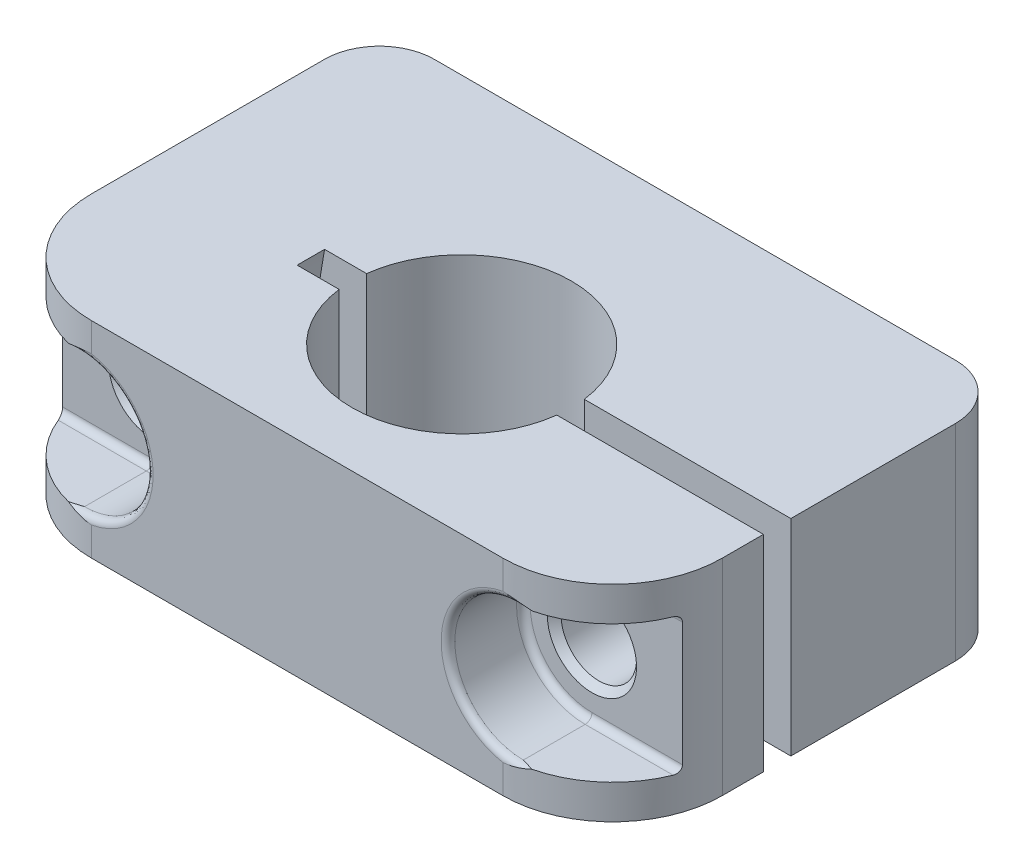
ISO-10303-21;
HEADER;
FILE_DESCRIPTION(('STEP AP214'),'2;1');
FILE_NAME('part.step','',(''),(''),'','','');
FILE_SCHEMA(('AUTOMOTIVE_DESIGN { 1 0 10303 214 1 1 1 1 }'));
ENDSEC;
DATA;
#1=APPLICATION_CONTEXT('core data for automotive mechanical design processes');
#2=APPLICATION_PROTOCOL_DEFINITION('international standard','automotive_design',2000,#1);
#3=PRODUCT_CONTEXT('',#1,'mechanical');
#4=PRODUCT('Part','Part','',(#3));
#5=PRODUCT_RELATED_PRODUCT_CATEGORY('part','',(#4));
#6=PRODUCT_DEFINITION_FORMATION('','',#4);
#7=PRODUCT_DEFINITION_CONTEXT('part definition',#1,'design');
#8=PRODUCT_DEFINITION('design','',#6,#7);
#9=PRODUCT_DEFINITION_SHAPE('','',#8);
#10=(LENGTH_UNIT() NAMED_UNIT(*) SI_UNIT(.MILLI.,.METRE.));
#11=(NAMED_UNIT(*) PLANE_ANGLE_UNIT() SI_UNIT($,.RADIAN.));
#12=(NAMED_UNIT(*) SI_UNIT($,.STERADIAN.) SOLID_ANGLE_UNIT());
#13=UNCERTAINTY_MEASURE_WITH_UNIT(LENGTH_MEASURE(1.E-05),#10,'distance_accuracy_value','');
#14=(GEOMETRIC_REPRESENTATION_CONTEXT(3) GLOBAL_UNCERTAINTY_ASSIGNED_CONTEXT((#13)) GLOBAL_UNIT_ASSIGNED_CONTEXT((#10,
#11,#12)) REPRESENTATION_CONTEXT('',''));
#15=CARTESIAN_POINT('',(0.,0.,0.));
#16=DIRECTION('',(0.,0.,1.));
#17=DIRECTION('',(1.,0.,0.));
#18=AXIS2_PLACEMENT_3D('',#15,#16,#17);
#19=CARTESIAN_POINT('',(32.,0.,24.));
#20=DIRECTION('',(0.,0.,-1.));
#21=DIRECTION('',(0.,1.,0.));
#22=AXIS2_PLACEMENT_3D('',#19,#20,#21);
#23=TOROIDAL_SURFACE('',#22,4.5,0.500000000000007);
#24=CARTESIAN_POINT('',(32.,0.,23.5));
#25=DIRECTION('',(0.,0.,-1.));
#26=DIRECTION('',(0.,-1.,0.));
#27=AXIS2_PLACEMENT_3D('',#24,#25,#26);
#28=CIRCLE('',#27,4.5);
#29=CARTESIAN_POINT('',(32.,4.5,23.5));
#30=VERTEX_POINT('',#29);
#31=CARTESIAN_POINT('',(32.,-4.5,23.5));
#32=VERTEX_POINT('',#31);
#33=EDGE_CURVE('E230',#30,#32,#28,.F.);
#34=ORIENTED_EDGE('',*,*,#33,.F.);
#35=CARTESIAN_POINT('',(32.,4.5,24.));
#36=DIRECTION('',(1.,0.,0.));
#37=DIRECTION('',(0.,1.,0.));
#38=AXIS2_PLACEMENT_3D('',#35,#36,#37);
#39=CIRCLE('',#38,0.5);
#40=CARTESIAN_POINT('',(32.,5.,24.));
#41=VERTEX_POINT('',#40);
#42=EDGE_CURVE('E221',#30,#41,#39,.T.);
#43=ORIENTED_EDGE('',*,*,#42,.T.);
#44=CARTESIAN_POINT('',(32.,0.,24.));
#45=DIRECTION('',(0.,0.,1.));
#46=DIRECTION('',(0.,-1.,0.));
#47=AXIS2_PLACEMENT_3D('',#44,#45,#46);
#48=CIRCLE('',#47,5.);
#49=CARTESIAN_POINT('',(32.,-5.,24.));
#50=VERTEX_POINT('',#49);
#51=EDGE_CURVE('E609',#41,#50,#48,.T.);
#52=ORIENTED_EDGE('',*,*,#51,.T.);
#53=CARTESIAN_POINT('',(32.,-4.5,24.));
#54=DIRECTION('',(1.,0.,0.));
#55=DIRECTION('',(0.,1.,0.));
#56=AXIS2_PLACEMENT_3D('',#53,#54,#55);
#57=CIRCLE('',#56,0.500000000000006);
#58=EDGE_CURVE('E222',#50,#32,#57,.T.);
#59=ORIENTED_EDGE('',*,*,#58,.T.);
#60=EDGE_LOOP('',(#34,#43,#52,#59));
#61=FACE_BOUND('',#60,.T.);
#62=ADVANCED_FACE('F14',(#61),#23,.F.);
#63=CARTESIAN_POINT('',(46.,-4.5,24.));
#64=DIRECTION('',(1.,0.,0.));
#65=DIRECTION('',(0.,1.,0.));
#66=AXIS2_PLACEMENT_3D('',#63,#64,#65);
#67=CYLINDRICAL_SURFACE('',#66,0.500000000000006);
#68=DIRECTION('',(1.,0.,0.));
#69=VECTOR('',#68,1.);
#70=CARTESIAN_POINT('',(36.5,-4.5,23.5));
#71=LINE('',#70,#69);
#72=CARTESIAN_POINT('',(38.5993420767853,-4.5,23.5));
#73=VERTEX_POINT('',#72);
#74=EDGE_CURVE('E215',#32,#73,#71,.T.);
#75=ORIENTED_EDGE('',*,*,#74,.F.);
#76=ORIENTED_EDGE('',*,*,#58,.F.);
#77=DIRECTION('',(-1.,0.,0.));
#78=VECTOR('',#77,1.);
#79=CARTESIAN_POINT('',(46.,-5.,24.));
#80=LINE('',#79,#78);
#81=CARTESIAN_POINT('',(38.4161984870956,-5.,24.));
#82=VERTEX_POINT('',#81);
#83=EDGE_CURVE('E217',#82,#50,#80,.T.);
#84=ORIENTED_EDGE('',*,*,#83,.F.);
#85=CARTESIAN_POINT('',(38.5993420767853,-4.5,23.5));
#86=CARTESIAN_POINT('',(38.5993472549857,-4.52705093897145,23.4999717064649));
#87=CARTESIAN_POINT('',(38.5986204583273,-4.55408810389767,23.5021933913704));
#88=CARTESIAN_POINT('',(38.595743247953,-4.60733048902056,23.5109205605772));
#89=CARTESIAN_POINT('',(38.5935956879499,-4.63353726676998,23.5174174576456));
#90=CARTESIAN_POINT('',(38.587916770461,-4.6844308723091,23.5344811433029));
#91=CARTESIAN_POINT('',(38.5843853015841,-4.70911757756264,23.5450482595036));
#92=CARTESIAN_POINT('',(38.576010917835,-4.75631760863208,23.5698697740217));
#93=CARTESIAN_POINT('',(38.5711677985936,-4.77883059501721,23.584124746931));
#94=CARTESIAN_POINT('',(38.5601670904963,-4.82151617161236,23.616135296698));
#95=CARTESIAN_POINT('',(38.5539871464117,-4.84163860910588,23.6339499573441));
#96=CARTESIAN_POINT('',(38.540494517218,-4.87860762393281,23.6723315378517));
#97=CARTESIAN_POINT('',(38.533181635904,-4.89545363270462,23.6928989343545));
#98=CARTESIAN_POINT('',(38.5171995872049,-4.92626394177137,23.7372047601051));
#99=CARTESIAN_POINT('',(38.5084824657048,-4.94005314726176,23.761047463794));
#100=CARTESIAN_POINT('',(38.4901540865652,-4.96345838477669,23.8103887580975));
#101=CARTESIAN_POINT('',(38.4805424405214,-4.97307259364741,23.8358880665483));
#102=CARTESIAN_POINT('',(38.4619351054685,-4.98703519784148,23.8844596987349));
#103=CARTESIAN_POINT('',(38.4530220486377,-4.99190606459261,23.9074159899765));
#104=CARTESIAN_POINT('',(38.4348426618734,-4.99838827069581,23.9535979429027));
#105=CARTESIAN_POINT('',(38.4255770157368,-5.00000562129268,23.9768230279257));
#106=CARTESIAN_POINT('',(38.4161984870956,-5.,24.));
#107=B_SPLINE_CURVE_WITH_KNOTS('',3,(#85,#86,#87,#88,#89,#90,#91,#92,#93,#94,#95,#96,#97,#98,
#99,#100,#101,#102,#103,#104,#105,#106),.UNSPECIFIED.,.F.,.F.,(4,2,2,2,2,2,2,2,2,2,4),(0.,
0.0810309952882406,0.161899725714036,0.242774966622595,0.323662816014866,0.406025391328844,
0.488402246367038,0.574695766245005,0.661026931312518,0.736122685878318,0.811079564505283),.UNSPECIFIED.);
#108=EDGE_CURVE('E19',#73,#82,#107,.T.);
#109=ORIENTED_EDGE('',*,*,#108,.F.);
#110=EDGE_LOOP('',(#75,#76,#84,#109));
#111=FACE_BOUND('',#110,.T.);
#112=ADVANCED_FACE('F214',(#111),#67,.F.);
#113=CARTESIAN_POINT('',(46.,4.5,24.));
#114=DIRECTION('',(1.,0.,0.));
#115=DIRECTION('',(0.,1.,0.));
#116=AXIS2_PLACEMENT_3D('',#113,#114,#115);
#117=CYLINDRICAL_SURFACE('',#116,0.5);
#118=DIRECTION('',(1.,0.,0.));
#119=VECTOR('',#118,1.);
#120=CARTESIAN_POINT('',(46.,5.,24.));
#121=LINE('',#120,#119);
#122=CARTESIAN_POINT('',(38.4161984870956,5.,24.));
#123=VERTEX_POINT('',#122);
#124=EDGE_CURVE('E524',#41,#123,#121,.T.);
#125=ORIENTED_EDGE('',*,*,#124,.F.);
#126=ORIENTED_EDGE('',*,*,#42,.F.);
#127=DIRECTION('',(1.,0.,0.));
#128=VECTOR('',#127,1.);
#129=CARTESIAN_POINT('',(36.5,4.5,23.5));
#130=LINE('',#129,#128);
#131=CARTESIAN_POINT('',(38.5993420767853,4.5,23.5));
#132=VERTEX_POINT('',#131);
#133=EDGE_CURVE('E233',#132,#30,#130,.F.);
#134=ORIENTED_EDGE('',*,*,#133,.F.);
#135=CARTESIAN_POINT('',(38.4161984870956,5.,24.));
#136=CARTESIAN_POINT('',(38.428045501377,5.00001889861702,23.9707330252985));
#137=CARTESIAN_POINT('',(38.4397122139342,4.99743034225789,23.9413745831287));
#138=CARTESIAN_POINT('',(38.4624186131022,4.98707503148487,23.8832710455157));
#139=CARTESIAN_POINT('',(38.4734570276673,4.97929815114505,23.8545272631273));
#140=CARTESIAN_POINT('',(38.4946105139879,4.95858481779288,23.7985209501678));
#141=CARTESIAN_POINT('',(38.504723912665,4.94563923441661,23.7712611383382));
#142=CARTESIAN_POINT('',(38.5237304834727,4.91482971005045,23.719235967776));
#143=CARTESIAN_POINT('',(38.5326249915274,4.89697121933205,23.6944678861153));
#144=CARTESIAN_POINT('',(38.5485796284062,4.85770420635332,23.6494322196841));
#145=CARTESIAN_POINT('',(38.5557066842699,4.83650387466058,23.6290070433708));
#146=CARTESIAN_POINT('',(38.5684743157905,4.79055670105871,23.5920224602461));
#147=CARTESIAN_POINT('',(38.5741147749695,4.76580958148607,23.5754633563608));
#148=CARTESIAN_POINT('',(38.5834735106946,4.71510936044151,23.5477698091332));
#149=CARTESIAN_POINT('',(38.5872873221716,4.6893194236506,23.5363680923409));
#150=CARTESIAN_POINT('',(38.5933890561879,4.63604246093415,23.5180423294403));
#151=CARTESIAN_POINT('',(38.5956791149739,4.60855787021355,23.5111120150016));
#152=CARTESIAN_POINT('',(38.5979030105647,4.56734483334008,23.5043710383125));
#153=CARTESIAN_POINT('',(38.59844279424,4.55392332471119,23.5027323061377));
#154=CARTESIAN_POINT('',(38.59916194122,4.52700352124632,23.5005476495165));
#155=CARTESIAN_POINT('',(38.5993418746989,4.51350538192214,23.4999999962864));
#156=CARTESIAN_POINT('',(38.5993420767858,4.5,23.5));
#157=B_SPLINE_CURVE_WITH_KNOTS('',3,(#135,#136,#137,#138,#139,#140,#141,#142,#143,#144,#145,
#146,#147,#148,#149,#150,#151,#152,#153,#154,#155,#156),.UNSPECIFIED.,.F.,.F.,(4,2,2,2,2,2,2,2,
2,2,4),(0.,0.0946423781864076,0.189470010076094,0.28446589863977,0.379356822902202,
0.469753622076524,0.560157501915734,0.645100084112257,0.729923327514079,0.77047716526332,
0.810966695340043),.UNSPECIFIED.);
#158=EDGE_CURVE('E237',#123,#132,#157,.T.);
#159=ORIENTED_EDGE('',*,*,#158,.F.);
#160=EDGE_LOOP('',(#125,#126,#134,#159));
#161=FACE_BOUND('',#160,.T.);
#162=ADVANCED_FACE('F823',(#161),#117,.F.);
#163=CARTESIAN_POINT('',(32.,0.,0.));
#164=DIRECTION('',(0.,0.,1.));
#165=DIRECTION('',(0.,-1.,0.));
#166=AXIS2_PLACEMENT_3D('',#163,#164,#165);
#167=CYLINDRICAL_SURFACE('',#166,5.);
#168=DIRECTION('',(0.,0.,1.));
#169=VECTOR('',#168,1.);
#170=CARTESIAN_POINT('',(32.,-5.,29.));
#171=LINE('',#170,#169);
#172=CARTESIAN_POINT('',(32.,-5.,28.5));
#173=VERTEX_POINT('',#172);
#174=EDGE_CURVE('E536',#50,#173,#171,.T.);
#175=ORIENTED_EDGE('',*,*,#174,.F.);
#176=ORIENTED_EDGE('',*,*,#51,.F.);
#177=DIRECTION('',(0.,0.,1.));
#178=VECTOR('',#177,1.);
#179=CARTESIAN_POINT('',(32.,5.,24.));
#180=LINE('',#179,#178);
#181=CARTESIAN_POINT('',(32.,5.,28.5));
#182=VERTEX_POINT('',#181);
#183=EDGE_CURVE('E533',#182,#41,#180,.F.);
#184=ORIENTED_EDGE('',*,*,#183,.F.);
#185=CARTESIAN_POINT('',(32.,0.,28.5));
#186=DIRECTION('',(0.,0.,-1.));
#187=DIRECTION('',(0.,1.,0.));
#188=AXIS2_PLACEMENT_3D('',#185,#186,#187);
#189=CIRCLE('',#188,5.);
#190=EDGE_CURVE('E468',#173,#182,#189,.T.);
#191=ORIENTED_EDGE('',*,*,#190,.F.);
#192=EDGE_LOOP('',(#175,#176,#184,#191));
#193=FACE_BOUND('',#192,.T.);
#194=ADVANCED_FACE('F826',(#193),#167,.F.);
#195=CARTESIAN_POINT('',(0.,0.,23.4999999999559));
#196=DIRECTION('',(0.,0.,1.));
#197=DIRECTION('',(0.,-1.,0.));
#198=AXIS2_PLACEMENT_3D('',#195,#196,#197);
#199=CONICAL_SURFACE('',#198,3.24999999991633,0.785398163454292);
#200=CARTESIAN_POINT('',(0.,0.,23.5000000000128));
#201=DIRECTION('',(0.,0.,1.));
#202=DIRECTION('',(0.,-1.,0.));
#203=AXIS2_PLACEMENT_3D('',#200,#201,#202);
#204=CIRCLE('',#203,3.24999999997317);
#205=CARTESIAN_POINT('',(0.,-3.24999999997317,23.5000000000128));
#206=VERTEX_POINT('',#205);
#207=EDGE_CURVE('E418',#206,#206,#204,.F.);
#208=ORIENTED_EDGE('',*,*,#207,.F.);
#209=EDGE_LOOP('',(#208));
#210=FACE_BOUND('',#209,.T.);
#211=CARTESIAN_POINT('',(0.,0.,23.));
#212=DIRECTION('',(0.,0.,1.));
#213=DIRECTION('',(0.,-1.,0.));
#214=AXIS2_PLACEMENT_3D('',#211,#212,#213);
#215=CIRCLE('',#214,2.75);
#216=CARTESIAN_POINT('',(0.,-2.75,23.));
#217=VERTEX_POINT('',#216);
#218=EDGE_CURVE('E553',#217,#217,#215,.F.);
#219=ORIENTED_EDGE('',*,*,#218,.T.);
#220=EDGE_LOOP('',(#219));
#221=FACE_BOUND('',#220,.T.);
#222=ADVANCED_FACE('F582',(#210,#221),#199,.F.);
#223=CARTESIAN_POINT('',(0.,0.,24.));
#224=DIRECTION('',(0.,0.,-1.));
#225=DIRECTION('',(0.,1.,0.));
#226=AXIS2_PLACEMENT_3D('',#223,#224,#225);
#227=TOROIDAL_SURFACE('',#226,4.5,0.500000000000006);
#228=CARTESIAN_POINT('',(0.,4.5,24.));
#229=DIRECTION('',(-1.,0.,0.));
#230=DIRECTION('',(0.,-1.,0.));
#231=AXIS2_PLACEMENT_3D('',#228,#229,#230);
#232=CIRCLE('',#231,0.5);
#233=CARTESIAN_POINT('',(0.,5.,24.));
#234=VERTEX_POINT('',#233);
#235=CARTESIAN_POINT('',(0.,4.5,23.5));
#236=VERTEX_POINT('',#235);
#237=EDGE_CURVE('E559',#234,#236,#232,.T.);
#238=ORIENTED_EDGE('',*,*,#237,.T.);
#239=CARTESIAN_POINT('',(0.,0.,23.5));
#240=DIRECTION('',(0.,0.,-1.));
#241=DIRECTION('',(0.,1.,0.));
#242=AXIS2_PLACEMENT_3D('',#239,#240,#241);
#243=CIRCLE('',#242,4.5);
#244=CARTESIAN_POINT('',(0.,-4.5,23.5));
#245=VERTEX_POINT('',#244);
#246=EDGE_CURVE('E379',#245,#236,#243,.F.);
#247=ORIENTED_EDGE('',*,*,#246,.F.);
#248=CARTESIAN_POINT('',(0.,-4.5,24.));
#249=DIRECTION('',(-1.,0.,0.));
#250=DIRECTION('',(0.,-1.,0.));
#251=AXIS2_PLACEMENT_3D('',#248,#249,#250);
#252=CIRCLE('',#251,0.500000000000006);
#253=CARTESIAN_POINT('',(0.,-5.,24.));
#254=VERTEX_POINT('',#253);
#255=EDGE_CURVE('E566',#245,#254,#252,.T.);
#256=ORIENTED_EDGE('',*,*,#255,.T.);
#257=CARTESIAN_POINT('',(0.,0.,24.));
#258=DIRECTION('',(0.,0.,1.));
#259=DIRECTION('',(0.,-1.,0.));
#260=AXIS2_PLACEMENT_3D('',#257,#258,#259);
#261=CIRCLE('',#260,5.);
#262=EDGE_CURVE('E556',#254,#234,#261,.T.);
#263=ORIENTED_EDGE('',*,*,#262,.T.);
#264=EDGE_LOOP('',(#238,#247,#256,#263));
#265=FACE_BOUND('',#264,.T.);
#266=ADVANCED_FACE('F576',(#265),#227,.F.);
#267=CARTESIAN_POINT('',(-14.,-4.5,24.));
#268=DIRECTION('',(-1.,0.,0.));
#269=DIRECTION('',(0.,-1.,0.));
#270=AXIS2_PLACEMENT_3D('',#267,#268,#269);
#271=CYLINDRICAL_SURFACE('',#270,0.500000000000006);
#272=ORIENTED_EDGE('',*,*,#255,.F.);
#273=DIRECTION('',(1.,0.,0.));
#274=VECTOR('',#273,1.);
#275=CARTESIAN_POINT('',(4.5,-4.5,23.5));
#276=LINE('',#275,#274);
#277=CARTESIAN_POINT('',(-6.59934207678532,-4.5,23.5));
#278=VERTEX_POINT('',#277);
#279=EDGE_CURVE('E371',#278,#245,#276,.T.);
#280=ORIENTED_EDGE('',*,*,#279,.F.);
#281=CARTESIAN_POINT('',(-6.41619848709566,-5.,24.));
#282=CARTESIAN_POINT('',(-6.42804550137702,-5.00001889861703,23.9707330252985));
#283=CARTESIAN_POINT('',(-6.4397122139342,-4.9974303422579,23.9413745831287));
#284=CARTESIAN_POINT('',(-6.46241861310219,-4.98707503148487,23.8832710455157));
#285=CARTESIAN_POINT('',(-6.47345702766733,-4.97929815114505,23.8545272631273));
#286=CARTESIAN_POINT('',(-6.49461051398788,-4.95858481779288,23.7985209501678));
#287=CARTESIAN_POINT('',(-6.50472391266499,-4.94563923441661,23.7712611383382));
#288=CARTESIAN_POINT('',(-6.52373048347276,-4.91482971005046,23.719235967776));
#289=CARTESIAN_POINT('',(-6.53262499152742,-4.89697121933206,23.6944678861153));
#290=CARTESIAN_POINT('',(-6.54857962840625,-4.85770420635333,23.6494322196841));
#291=CARTESIAN_POINT('',(-6.55570668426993,-4.83650387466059,23.6290070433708));
#292=CARTESIAN_POINT('',(-6.56847431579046,-4.79055670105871,23.5920224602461));
#293=CARTESIAN_POINT('',(-6.5741147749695,-4.76580958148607,23.5754633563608));
#294=CARTESIAN_POINT('',(-6.58347351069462,-4.71510936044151,23.5477698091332));
#295=CARTESIAN_POINT('',(-6.58728732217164,-4.6893194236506,23.5363680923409));
#296=CARTESIAN_POINT('',(-6.59338905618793,-4.63604246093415,23.5180423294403));
#297=CARTESIAN_POINT('',(-6.5956791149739,-4.60855787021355,23.5111120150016));
#298=CARTESIAN_POINT('',(-6.59790301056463,-4.56734483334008,23.5043710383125));
#299=CARTESIAN_POINT('',(-6.59844279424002,-4.55392332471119,23.5027323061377));
#300=CARTESIAN_POINT('',(-6.59916194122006,-4.52700352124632,23.5005476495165));
#301=CARTESIAN_POINT('',(-6.59934187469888,-4.51350538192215,23.4999999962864));
#302=CARTESIAN_POINT('',(-6.59934207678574,-4.5,23.5));
#303=B_SPLINE_CURVE_WITH_KNOTS('',3,(#281,#282,#283,#284,#285,#286,#287,#288,#289,#290,#291,
#292,#293,#294,#295,#296,#297,#298,#299,#300,#301,#302),.UNSPECIFIED.,.F.,.F.,(4,2,2,2,2,2,2,2,
2,2,4),(0.,0.0946423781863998,0.189470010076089,0.284465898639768,0.379356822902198,
0.469753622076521,0.560157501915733,0.645100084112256,0.729923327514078,0.77047716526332,
0.810966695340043),.UNSPECIFIED.);
#304=CARTESIAN_POINT('',(-6.41619848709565,-5.,24.));
#305=VERTEX_POINT('',#304);
#306=EDGE_CURVE('E569',#305,#278,#303,.T.);
#307=ORIENTED_EDGE('',*,*,#306,.F.);
#308=DIRECTION('',(1.,0.,0.));
#309=VECTOR('',#308,1.);
#310=CARTESIAN_POINT('',(-14.,-5.,24.));
#311=LINE('',#310,#309);
#312=EDGE_CURVE('E419',#305,#254,#311,.T.);
#313=ORIENTED_EDGE('',*,*,#312,.T.);
#314=EDGE_LOOP('',(#272,#280,#307,#313));
#315=FACE_BOUND('',#314,.T.);
#316=ADVANCED_FACE('F581',(#315),#271,.F.);
#317=CARTESIAN_POINT('',(-14.,4.5,24.));
#318=DIRECTION('',(-1.,0.,0.));
#319=DIRECTION('',(0.,-1.,0.));
#320=AXIS2_PLACEMENT_3D('',#317,#318,#319);
#321=CYLINDRICAL_SURFACE('',#320,0.5);
#322=ORIENTED_EDGE('',*,*,#237,.F.);
#323=DIRECTION('',(-1.,0.,0.));
#324=VECTOR('',#323,1.);
#325=CARTESIAN_POINT('',(-14.,5.,24.));
#326=LINE('',#325,#324);
#327=CARTESIAN_POINT('',(-6.41619848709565,5.,24.));
#328=VERTEX_POINT('',#327);
#329=EDGE_CURVE('E360',#234,#328,#326,.T.);
#330=ORIENTED_EDGE('',*,*,#329,.T.);
#331=CARTESIAN_POINT('',(-6.59934207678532,4.5,23.5));
#332=CARTESIAN_POINT('',(-6.59934725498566,4.52705093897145,23.4999717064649));
#333=CARTESIAN_POINT('',(-6.59862045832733,4.55408810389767,23.5021933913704));
#334=CARTESIAN_POINT('',(-6.59574324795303,4.60733048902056,23.5109205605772));
#335=CARTESIAN_POINT('',(-6.59359568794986,4.63353726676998,23.5174174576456));
#336=CARTESIAN_POINT('',(-6.587916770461,4.6844308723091,23.5344811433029));
#337=CARTESIAN_POINT('',(-6.58438530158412,4.70911757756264,23.5450482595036));
#338=CARTESIAN_POINT('',(-6.57601091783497,4.75631760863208,23.5698697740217));
#339=CARTESIAN_POINT('',(-6.57116779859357,4.77883059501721,23.584124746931));
#340=CARTESIAN_POINT('',(-6.56016709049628,4.82151617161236,23.616135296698));
#341=CARTESIAN_POINT('',(-6.55398714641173,4.84163860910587,23.6339499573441));
#342=CARTESIAN_POINT('',(-6.54049451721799,4.87860762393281,23.6723315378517));
#343=CARTESIAN_POINT('',(-6.53318163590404,4.89545363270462,23.6928989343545));
#344=CARTESIAN_POINT('',(-6.5171995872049,4.92626394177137,23.7372047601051));
#345=CARTESIAN_POINT('',(-6.50848246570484,4.94005314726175,23.761047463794));
#346=CARTESIAN_POINT('',(-6.49015408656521,4.96345838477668,23.8103887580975));
#347=CARTESIAN_POINT('',(-6.48054244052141,4.97307259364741,23.8358880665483));
#348=CARTESIAN_POINT('',(-6.46193510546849,4.98703519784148,23.8844596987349));
#349=CARTESIAN_POINT('',(-6.45302204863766,4.9919060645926,23.9074159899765));
#350=CARTESIAN_POINT('',(-6.43484266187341,4.9983882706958,23.9535979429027));
#351=CARTESIAN_POINT('',(-6.4255770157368,5.00000562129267,23.9768230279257));
#352=CARTESIAN_POINT('',(-6.41619848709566,5.,24.));
#353=B_SPLINE_CURVE_WITH_KNOTS('',3,(#331,#332,#333,#334,#335,#336,#337,#338,#339,#340,#341,
#342,#343,#344,#345,#346,#347,#348,#349,#350,#351,#352),.UNSPECIFIED.,.F.,.F.,(4,2,2,2,2,2,2,2,
2,2,4),(0.,0.0810309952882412,0.161899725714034,0.242774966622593,0.323662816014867,
0.406025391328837,0.488402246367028,0.574695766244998,0.66102693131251,0.736122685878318,
0.811079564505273),.UNSPECIFIED.);
#354=CARTESIAN_POINT('',(-6.59934207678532,4.5,23.5));
#355=VERTEX_POINT('',#354);
#356=EDGE_CURVE('E561',#355,#328,#353,.T.);
#357=ORIENTED_EDGE('',*,*,#356,.F.);
#358=DIRECTION('',(1.,0.,0.));
#359=VECTOR('',#358,1.);
#360=CARTESIAN_POINT('',(4.5,4.5,23.5));
#361=LINE('',#360,#359);
#362=EDGE_CURVE('E918',#236,#355,#361,.F.);
#363=ORIENTED_EDGE('',*,*,#362,.F.);
#364=EDGE_LOOP('',(#322,#330,#357,#363));
#365=FACE_BOUND('',#364,.T.);
#366=ADVANCED_FACE('F735',(#365),#321,.F.);
#367=CARTESIAN_POINT('',(0.,0.,0.));
#368=DIRECTION('',(0.,0.,1.));
#369=DIRECTION('',(0.,-1.,0.));
#370=AXIS2_PLACEMENT_3D('',#367,#368,#369);
#371=CYLINDRICAL_SURFACE('',#370,5.);
#372=ORIENTED_EDGE('',*,*,#262,.F.);
#373=DIRECTION('',(0.,0.,1.));
#374=VECTOR('',#373,1.);
#375=CARTESIAN_POINT('',(0.,-5.,29.));
#376=LINE('',#375,#374);
#377=CARTESIAN_POINT('',(0.,-5.,28.5));
#378=VERTEX_POINT('',#377);
#379=EDGE_CURVE('E410',#254,#378,#376,.T.);
#380=ORIENTED_EDGE('',*,*,#379,.T.);
#381=CARTESIAN_POINT('',(0.,0.,28.5));
#382=DIRECTION('',(0.,0.,-1.));
#383=DIRECTION('',(0.,1.,0.));
#384=AXIS2_PLACEMENT_3D('',#381,#382,#383);
#385=CIRCLE('',#384,5.);
#386=CARTESIAN_POINT('',(0.,5.,28.5));
#387=VERTEX_POINT('',#386);
#388=EDGE_CURVE('E345',#387,#378,#385,.T.);
#389=ORIENTED_EDGE('',*,*,#388,.F.);
#390=DIRECTION('',(0.,0.,1.));
#391=VECTOR('',#390,1.);
#392=CARTESIAN_POINT('',(0.,5.,24.));
#393=LINE('',#392,#391);
#394=EDGE_CURVE('E368',#387,#234,#393,.F.);
#395=ORIENTED_EDGE('',*,*,#394,.T.);
#396=EDGE_LOOP('',(#372,#380,#389,#395));
#397=FACE_BOUND('',#396,.T.);
#398=ADVANCED_FACE('F1009',(#397),#371,.F.);
#399=CARTESIAN_POINT('',(0.,0.,0.));
#400=DIRECTION('',(0.,0.,1.));
#401=DIRECTION('',(0.,-1.,0.));
#402=AXIS2_PLACEMENT_3D('',#399,#400,#401);
#403=CYLINDRICAL_SURFACE('',#402,2.75);
#404=ORIENTED_EDGE('',*,*,#218,.F.);
#405=EDGE_LOOP('',(#404));
#406=FACE_BOUND('',#405,.T.);
#407=CARTESIAN_POINT('',(0.,0.,0.499999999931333));
#408=DIRECTION('',(0.,0.,-1.));
#409=DIRECTION('',(0.,1.,0.));
#410=AXIS2_PLACEMENT_3D('',#407,#408,#409);
#411=CIRCLE('',#410,2.74999999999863);
#412=CARTESIAN_POINT('',(0.,2.74999999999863,0.499999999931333));
#413=VERTEX_POINT('',#412);
#414=EDGE_CURVE('E281',#413,#413,#411,.T.);
#415=ORIENTED_EDGE('',*,*,#414,.T.);
#416=EDGE_LOOP('',(#415));
#417=FACE_BOUND('',#416,.T.);
#418=ADVANCED_FACE('F1006',(#406,#417),#403,.F.);
#419=CARTESIAN_POINT('',(32.,0.,23.5000000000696));
#420=DIRECTION('',(0.,0.,1.));
#421=DIRECTION('',(-1.,0.,0.));
#422=AXIS2_PLACEMENT_3D('',#419,#420,#421);
#423=CONICAL_SURFACE('',#422,3.25000000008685,0.785398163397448);
#424=CARTESIAN_POINT('',(32.,0.,23.5000000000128));
#425=DIRECTION('',(0.,0.,1.));
#426=DIRECTION('',(-1.,0.,0.));
#427=AXIS2_PLACEMENT_3D('',#424,#425,#426);
#428=CIRCLE('',#427,3.25000000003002);
#429=CARTESIAN_POINT('',(28.74999999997,0.,23.5000000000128));
#430=VERTEX_POINT('',#429);
#431=EDGE_CURVE('E532',#430,#430,#428,.F.);
#432=ORIENTED_EDGE('',*,*,#431,.F.);
#433=EDGE_LOOP('',(#432));
#434=FACE_BOUND('',#433,.T.);
#435=CARTESIAN_POINT('',(32.,0.,23.));
#436=DIRECTION('',(0.,0.,1.));
#437=DIRECTION('',(0.,-1.,0.));
#438=AXIS2_PLACEMENT_3D('',#435,#436,#437);
#439=CIRCLE('',#438,2.75);
#440=CARTESIAN_POINT('',(32.,-2.75,23.));
#441=VERTEX_POINT('',#440);
#442=EDGE_CURVE('E260',#441,#441,#439,.F.);
#443=ORIENTED_EDGE('',*,*,#442,.T.);
#444=EDGE_LOOP('',(#443));
#445=FACE_BOUND('',#444,.T.);
#446=ADVANCED_FACE('F1008',(#434,#445),#423,.F.);
#447=CARTESIAN_POINT('',(46.,-5.,29.));
#448=DIRECTION('',(0.,1.,0.));
#449=DIRECTION('',(-1.,0.,0.));
#450=AXIS2_PLACEMENT_3D('',#447,#448,#449);
#451=PLANE('',#450);
#452=ORIENTED_EDGE('',*,*,#174,.T.);
#453=CARTESIAN_POINT('',(32.8985700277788,-4.99999999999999,28.771449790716));
#454=CARTESIAN_POINT('',(32.8721469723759,-5.0000025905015,28.7642225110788));
#455=CARTESIAN_POINT('',(32.8457458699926,-5.00001248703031,28.7569150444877));
#456=CARTESIAN_POINT('',(32.7897438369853,-5.00003871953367,28.7412355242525));
#457=CARTESIAN_POINT('',(32.7601486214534,-5.00005569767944,28.7328430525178));
#458=CARTESIAN_POINT('',(32.6977911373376,-5.00008357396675,28.7149414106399));
#459=CARTESIAN_POINT('',(32.6650351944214,-5.00009360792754,28.705410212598));
#460=CARTESIAN_POINT('',(32.596382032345,-5.00010393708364,28.685192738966));
#461=CARTESIAN_POINT('',(32.5604912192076,-5.0001031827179,28.6744847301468));
#462=CARTESIAN_POINT('',(32.4855842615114,-5.00009275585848,28.6518906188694));
#463=CARTESIAN_POINT('',(32.4465741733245,-5.00008229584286,28.6399844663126));
#464=CARTESIAN_POINT('',(32.3654298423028,-5.00005805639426,28.6149940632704));
#465=CARTESIAN_POINT('',(32.3233007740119,-5.00004407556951,28.6018930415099));
#466=CARTESIAN_POINT('',(32.2359002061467,-5.00002066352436,28.5745420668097));
#467=CARTESIAN_POINT('',(32.1906324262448,-5.00001165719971,28.5602802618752));
#468=CARTESIAN_POINT('',(32.0969112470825,-5.00000003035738,28.5306740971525));
#469=CARTESIAN_POINT('',(32.0484594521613,-4.9999979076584,28.5153246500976));
#470=CARTESIAN_POINT('',(32.,-5.,28.5));
#471=B_SPLINE_CURVE_WITH_KNOTS('',3,(#453,#454,#455,#456,#457,#458,#459,#460,#461,#462,#463,
#464,#465,#466,#467,#468,#469,#470),.UNSPECIFIED.,.F.,.F.,(4,2,2,2,2,2,2,2,4),(0.,
0.0821807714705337,0.174466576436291,0.276809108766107,0.389170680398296,0.511529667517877,
0.643886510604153,0.786270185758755,0.938744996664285),.UNSPECIFIED.);
#472=CARTESIAN_POINT('',(32.8985700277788,-5.,28.771449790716));
#473=VERTEX_POINT('',#472);
#474=EDGE_CURVE('E442',#473,#173,#471,.T.);
#475=ORIENTED_EDGE('',*,*,#474,.F.);
#476=CARTESIAN_POINT('',(31.,-5.,21.));
#477=DIRECTION('',(0.,-1.,0.));
#478=DIRECTION('',(1.,0.,0.));
#479=AXIS2_PLACEMENT_3D('',#476,#477,#478);
#480=CIRCLE('',#479,8.);
#481=EDGE_CURVE('E713',#82,#473,#480,.T.);
#482=ORIENTED_EDGE('',*,*,#481,.F.);
#483=ORIENTED_EDGE('',*,*,#83,.T.);
#484=EDGE_LOOP('',(#452,#475,#482,#483));
#485=FACE_BOUND('',#484,.T.);
#486=ADVANCED_FACE('F514',(#485),#451,.T.);
#487=CARTESIAN_POINT('',(46.,5.,24.));
#488=DIRECTION('',(0.,-1.,0.));
#489=DIRECTION('',(1.,0.,0.));
#490=AXIS2_PLACEMENT_3D('',#487,#488,#489);
#491=PLANE('',#490);
#492=ORIENTED_EDGE('',*,*,#183,.T.);
#493=ORIENTED_EDGE('',*,*,#124,.T.);
#494=CARTESIAN_POINT('',(31.,5.,21.));
#495=DIRECTION('',(0.,-1.,0.));
#496=DIRECTION('',(1.,0.,0.));
#497=AXIS2_PLACEMENT_3D('',#494,#495,#496);
#498=CIRCLE('',#497,8.);
#499=CARTESIAN_POINT('',(32.8985700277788,5.,28.771449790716));
#500=VERTEX_POINT('',#499);
#501=EDGE_CURVE('E240',#500,#123,#498,.F.);
#502=ORIENTED_EDGE('',*,*,#501,.F.);
#503=CARTESIAN_POINT('',(32.,5.,28.5));
#504=CARTESIAN_POINT('',(32.0484594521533,4.9999979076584,28.5153246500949));
#505=CARTESIAN_POINT('',(32.0969112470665,5.00000003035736,28.5306740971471));
#506=CARTESIAN_POINT('',(32.190632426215,5.00001165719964,28.5602802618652));
#507=CARTESIAN_POINT('',(32.2359002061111,5.00002066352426,28.5745420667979));
#508=CARTESIAN_POINT('',(32.3233007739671,5.00004407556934,28.6018930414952));
#509=CARTESIAN_POINT('',(32.3654298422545,5.00005805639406,28.6149940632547));
#510=CARTESIAN_POINT('',(32.4465741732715,5.00008229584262,28.6399844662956));
#511=CARTESIAN_POINT('',(32.4855842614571,5.00009275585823,28.6518906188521));
#512=CARTESIAN_POINT('',(32.5604912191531,5.00010318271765,28.6744847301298));
#513=CARTESIAN_POINT('',(32.5963820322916,5.0001039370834,28.6851927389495));
#514=CARTESIAN_POINT('',(32.6650351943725,5.00009360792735,28.7054102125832));
#515=CARTESIAN_POINT('',(32.6977911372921,5.00008357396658,28.7149414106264));
#516=CARTESIAN_POINT('',(32.7601486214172,5.00005569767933,28.7328430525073));
#517=CARTESIAN_POINT('',(32.7897438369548,5.0000387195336,28.7412355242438));
#518=CARTESIAN_POINT('',(32.8457458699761,5.00001248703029,28.7569150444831));
#519=CARTESIAN_POINT('',(32.8721469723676,5.0000025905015,28.7642225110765));
#520=CARTESIAN_POINT('',(32.8985700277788,4.99999999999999,28.771449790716));
#521=B_SPLINE_CURVE_WITH_KNOTS('',3,(#503,#504,#505,#506,#507,#508,#509,#510,#511,#512,#513,
#514,#515,#516,#517,#518,#519,#520),.UNSPECIFIED.,.F.,.F.,(4,2,2,2,2,2,2,2,4),(0.,
0.152474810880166,0.294858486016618,0.427215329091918,0.549574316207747,0.66193588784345,
0.764278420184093,0.856564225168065,0.938744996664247),.UNSPECIFIED.);
#522=EDGE_CURVE('E424',#182,#500,#521,.T.);
#523=ORIENTED_EDGE('',*,*,#522,.F.);
#524=EDGE_LOOP('',(#492,#493,#502,#523));
#525=FACE_BOUND('',#524,.T.);
#526=ADVANCED_FACE('F510',(#525),#491,.T.);
#527=CARTESIAN_POINT('',(36.5,0.,23.5));
#528=DIRECTION('',(0.,0.,1.));
#529=DIRECTION('',(0.,-1.,0.));
#530=AXIS2_PLACEMENT_3D('',#527,#528,#529);
#531=PLANE('',#530);
#532=DIRECTION('',(0.,-1.,0.));
#533=VECTOR('',#532,1.);
#534=CARTESIAN_POINT('',(38.5993420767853,-7.5,23.5));
#535=LINE('',#534,#533);
#536=EDGE_CURVE('E228',#132,#73,#535,.T.);
#537=ORIENTED_EDGE('',*,*,#536,.F.);
#538=ORIENTED_EDGE('',*,*,#133,.T.);
#539=ORIENTED_EDGE('',*,*,#33,.T.);
#540=ORIENTED_EDGE('',*,*,#74,.T.);
#541=EDGE_LOOP('',(#537,#538,#539,#540));
#542=FACE_BOUND('',#541,.T.);
#543=ORIENTED_EDGE('',*,*,#431,.T.);
#544=EDGE_LOOP('',(#543));
#545=FACE_BOUND('',#544,.T.);
#546=ADVANCED_FACE('F225',(#542,#545),#531,.T.);
#547=CARTESIAN_POINT('',(32.,0.,28.5));
#548=DIRECTION('',(0.,0.,-1.));
#549=DIRECTION('',(0.,1.,0.));
#550=AXIS2_PLACEMENT_3D('',#547,#548,#549);
#551=TOROIDAL_SURFACE('',#550,5.5,0.5);
#552=CARTESIAN_POINT('',(32.8985700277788,4.99999999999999,28.771449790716));
#553=CARTESIAN_POINT('',(32.8488033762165,5.01691359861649,28.7835744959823));
#554=CARTESIAN_POINT('',(32.798815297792,5.03350399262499,28.7952445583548));
#555=CARTESIAN_POINT('',(32.6806346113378,5.07172235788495,28.8216464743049));
#556=CARTESIAN_POINT('',(32.6122615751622,5.09305471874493,28.835999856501));
#557=CARTESIAN_POINT('',(32.4563463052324,5.1397755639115,28.8666618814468));
#558=CARTESIAN_POINT('',(32.3685705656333,5.1647218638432,28.8824659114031));
#559=CARTESIAN_POINT('',(32.1874428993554,5.21296030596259,28.9119048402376));
#560=CARTESIAN_POINT('',(32.0940293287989,5.23611036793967,28.9253944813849));
#561=CARTESIAN_POINT('',(31.8884218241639,5.28286889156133,28.9513265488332));
#562=CARTESIAN_POINT('',(31.7759766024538,5.30575655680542,28.963103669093));
#563=CARTESIAN_POINT('',(31.5763565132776,5.34115924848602,28.9796937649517));
#564=CARTESIAN_POINT('',(31.4894702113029,5.35484762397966,28.9854938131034));
#565=CARTESIAN_POINT('',(31.3285711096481,5.37676051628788,28.9935853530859));
#566=CARTESIAN_POINT('',(31.254649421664,5.38550298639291,28.9962812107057));
#567=CARTESIAN_POINT('',(31.1204708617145,5.39893414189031,28.9993117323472));
#568=CARTESIAN_POINT('',(31.060266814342,5.40407643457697,28.99999588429));
#569=CARTESIAN_POINT('',(31.,5.40832691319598,29.));
#570=B_SPLINE_CURVE_WITH_KNOTS('',3,(#552,#553,#554,#555,#556,#557,#558,#559,#560,#561,#562,
#563,#564,#565,#566,#567,#568,#569),.UNSPECIFIED.,.F.,.F.,(4,2,2,2,2,2,2,2,4),(0.,
0.161825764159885,0.380934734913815,0.658677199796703,0.950105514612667,1.29592357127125,
1.56025786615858,1.7836380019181,1.96487894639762),.UNSPECIFIED.);
#571=CARTESIAN_POINT('',(31.,5.40832691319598,29.));
#572=VERTEX_POINT('',#571);
#573=EDGE_CURVE('E245',#572,#500,#570,.F.);
#574=ORIENTED_EDGE('',*,*,#573,.F.);
#575=CARTESIAN_POINT('',(32.,0.,29.));
#576=DIRECTION('',(0.,0.,1.));
#577=DIRECTION('',(-0.18181818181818,0.983332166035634,0.));
#578=AXIS2_PLACEMENT_3D('',#575,#576,#577);
#579=CIRCLE('',#578,5.5);
#580=CARTESIAN_POINT('',(31.,-5.40832691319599,29.));
#581=VERTEX_POINT('',#580);
#582=EDGE_CURVE('E478',#572,#581,#579,.T.);
#583=ORIENTED_EDGE('',*,*,#582,.T.);
#584=CARTESIAN_POINT('',(31.,-5.408326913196,29.));
#585=CARTESIAN_POINT('',(31.0613798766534,-5.4039969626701,28.9999957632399));
#586=CARTESIAN_POINT('',(31.1226939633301,-5.39874036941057,28.9992859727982));
#587=CARTESIAN_POINT('',(31.2589745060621,-5.38501858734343,28.9961505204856));
#588=CARTESIAN_POINT('',(31.333887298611,-5.37609630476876,28.9933725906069));
#589=CARTESIAN_POINT('',(31.4966423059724,-5.3537613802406,28.9850569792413));
#590=CARTESIAN_POINT('',(31.5843926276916,-5.33983028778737,28.9791135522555));
#591=CARTESIAN_POINT('',(31.7719157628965,-5.30632288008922,28.9633190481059));
#592=CARTESIAN_POINT('',(31.8715560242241,-5.28621734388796,28.9530214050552));
#593=CARTESIAN_POINT('',(32.0790227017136,-5.2399116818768,28.9276364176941));
#594=CARTESIAN_POINT('',(32.1867148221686,-5.21331138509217,28.9121836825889));
#595=CARTESIAN_POINT('',(32.3806911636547,-5.16130069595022,28.8803106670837));
#596=CARTESIAN_POINT('',(32.4672754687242,-5.13656860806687,28.8645890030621));
#597=CARTESIAN_POINT('',(32.6205234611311,-5.09047458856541,28.8342614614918));
#598=CARTESIAN_POINT('',(32.6874196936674,-5.06955138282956,28.820157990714));
#599=CARTESIAN_POINT('',(32.8023503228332,-5.03232468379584,28.7944111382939));
#600=CARTESIAN_POINT('',(32.8505637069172,-5.01631345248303,28.7831426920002));
#601=CARTESIAN_POINT('',(32.8985700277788,-4.99999999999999,28.771449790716));
#602=B_SPLINE_CURVE_WITH_KNOTS('',3,(#584,#585,#586,#587,#588,#589,#590,#591,#592,#593,#594,
#595,#596,#597,#598,#599,#600,#601),.UNSPECIFIED.,.F.,.F.,(4,2,2,2,2,2,2,2,4),(0.,
0.184587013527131,0.410987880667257,0.678011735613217,0.984358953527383,1.32016809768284,
1.59431866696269,1.80877650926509,1.96487514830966),.UNSPECIFIED.);
#603=EDGE_CURVE('E430',#473,#581,#602,.F.);
#604=ORIENTED_EDGE('',*,*,#603,.F.);
#605=ORIENTED_EDGE('',*,*,#474,.T.);
#606=ORIENTED_EDGE('',*,*,#190,.T.);
#607=ORIENTED_EDGE('',*,*,#522,.T.);
#608=EDGE_LOOP('',(#574,#583,#604,#605,#606,#607));
#609=FACE_BOUND('',#608,.T.);
#610=ADVANCED_FACE('F398',(#609),#551,.T.);
#611=CARTESIAN_POINT('',(-14.,-5.,29.));
#612=DIRECTION('',(0.,-1.,0.));
#613=DIRECTION('',(1.,0.,0.));
#614=AXIS2_PLACEMENT_3D('',#611,#612,#613);
#615=PLANE('',#614);
#616=ORIENTED_EDGE('',*,*,#379,.F.);
#617=ORIENTED_EDGE('',*,*,#312,.F.);
#618=CARTESIAN_POINT('',(1.,-5.,21.));
#619=DIRECTION('',(0.,-1.,0.));
#620=DIRECTION('',(1.,0.,0.));
#621=AXIS2_PLACEMENT_3D('',#618,#619,#620);
#622=CIRCLE('',#621,8.);
#623=CARTESIAN_POINT('',(-0.898570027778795,-5.,28.771449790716));
#624=VERTEX_POINT('',#623);
#625=EDGE_CURVE('E703',#624,#305,#622,.T.);
#626=ORIENTED_EDGE('',*,*,#625,.F.);
#627=CARTESIAN_POINT('',(0.,-5.,28.5));
#628=CARTESIAN_POINT('',(-0.0484594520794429,-4.99999790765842,28.5153246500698));
#629=CARTESIAN_POINT('',(-0.0969112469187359,-5.00000003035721,28.5306740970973));
#630=CARTESIAN_POINT('',(-0.190632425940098,-5.00001165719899,28.5602802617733));
#631=CARTESIAN_POINT('',(-0.235900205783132,-5.0000206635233,28.5745420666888));
#632=CARTESIAN_POINT('',(-0.323300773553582,-5.00004407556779,28.6018930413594));
#633=CARTESIAN_POINT('',(-0.365429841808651,-5.00005805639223,28.6149940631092));
#634=CARTESIAN_POINT('',(-0.446574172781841,-5.00008229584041,28.6399844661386));
#635=CARTESIAN_POINT('',(-0.485584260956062,-5.00009275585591,28.6518906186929));
#636=CARTESIAN_POINT('',(-0.560491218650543,-5.00010318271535,28.6744847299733));
#637=CARTESIAN_POINT('',(-0.596382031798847,-5.0001039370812,28.6851927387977));
#638=CARTESIAN_POINT('',(-0.665035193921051,-5.00009360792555,28.7054102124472));
#639=CARTESIAN_POINT('',(-0.69779113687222,-5.00008357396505,28.7149414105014));
#640=CARTESIAN_POINT('',(-0.760148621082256,-5.00005569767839,28.7328430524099));
#641=CARTESIAN_POINT('',(-0.789743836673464,-5.00003871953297,28.7412355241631));
#642=CARTESIAN_POINT('',(-0.845745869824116,-5.0000124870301,28.7569150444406));
#643=CARTESIAN_POINT('',(-0.872146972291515,-5.00000259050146,28.7642225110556));
#644=CARTESIAN_POINT('',(-0.898570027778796,-4.99999999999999,28.771449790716));
#645=B_SPLINE_CURVE_WITH_KNOTS('',3,(#627,#628,#629,#630,#631,#632,#633,#634,#635,#636,#637,
#638,#639,#640,#641,#642,#643,#644),.UNSPECIFIED.,.F.,.F.,(4,2,2,2,2,2,2,2,4),(0.,
0.152474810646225,0.294858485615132,0.42721532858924,0.549574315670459,0.661935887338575,
0.764278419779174,0.856564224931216,0.938744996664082),.UNSPECIFIED.);
#646=EDGE_CURVE('E291',#378,#624,#645,.T.);
#647=ORIENTED_EDGE('',*,*,#646,.F.);
#648=EDGE_LOOP('',(#616,#617,#626,#647));
#649=FACE_BOUND('',#648,.T.);
#650=ADVANCED_FACE('F394',(#649),#615,.F.);
#651=CARTESIAN_POINT('',(4.5,0.,23.5));
#652=DIRECTION('',(0.,0.,1.));
#653=DIRECTION('',(0.,-1.,0.));
#654=AXIS2_PLACEMENT_3D('',#651,#652,#653);
#655=PLANE('',#654);
#656=DIRECTION('',(0.,-1.,0.));
#657=VECTOR('',#656,1.);
#658=CARTESIAN_POINT('',(-6.59934207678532,-7.5,23.5));
#659=LINE('',#658,#657);
#660=EDGE_CURVE('E700',#278,#355,#659,.F.);
#661=ORIENTED_EDGE('',*,*,#660,.F.);
#662=ORIENTED_EDGE('',*,*,#279,.T.);
#663=ORIENTED_EDGE('',*,*,#246,.T.);
#664=ORIENTED_EDGE('',*,*,#362,.T.);
#665=EDGE_LOOP('',(#661,#662,#663,#664));
#666=FACE_BOUND('',#665,.T.);
#667=ORIENTED_EDGE('',*,*,#207,.T.);
#668=EDGE_LOOP('',(#667));
#669=FACE_BOUND('',#668,.T.);
#670=ADVANCED_FACE('F385',(#666,#669),#655,.T.);
#671=CARTESIAN_POINT('',(-14.,5.,24.));
#672=DIRECTION('',(0.,1.,0.));
#673=DIRECTION('',(-1.,0.,0.));
#674=AXIS2_PLACEMENT_3D('',#671,#672,#673);
#675=PLANE('',#674);
#676=ORIENTED_EDGE('',*,*,#394,.F.);
#677=CARTESIAN_POINT('',(-0.898570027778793,4.99999999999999,28.771449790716));
#678=CARTESIAN_POINT('',(-0.872146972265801,5.00000259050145,28.7642225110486));
#679=CARTESIAN_POINT('',(-0.845745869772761,5.00001248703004,28.7569150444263));
#680=CARTESIAN_POINT('',(-0.78974383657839,5.00003871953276,28.7412355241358));
#681=CARTESIAN_POINT('',(-0.760148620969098,5.00005569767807,28.7328430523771));
#682=CARTESIAN_POINT('',(-0.697791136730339,5.00008357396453,28.7149414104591));
#683=CARTESIAN_POINT('',(-0.665035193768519,5.00009360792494,28.7054102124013));
#684=CARTESIAN_POINT('',(-0.596382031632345,5.00010393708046,28.6851927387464));
#685=CARTESIAN_POINT('',(-0.560491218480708,5.00010318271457,28.6744847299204));
#686=CARTESIAN_POINT('',(-0.485584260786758,5.00009275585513,28.6518906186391));
#687=CARTESIAN_POINT('',(-0.446574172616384,5.00008229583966,28.6399844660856));
#688=CARTESIAN_POINT('',(-0.365429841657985,5.00005805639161,28.6149940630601));
#689=CARTESIAN_POINT('',(-0.323300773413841,5.00004407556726,28.6018930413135));
#690=CARTESIAN_POINT('',(-0.23590020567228,5.00002066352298,28.5745420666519));
#691=CARTESIAN_POINT('',(-0.190632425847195,5.00001165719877,28.5602802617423));
#692=CARTESIAN_POINT('',(-0.096911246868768,5.00000003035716,28.5306740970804));
#693=CARTESIAN_POINT('',(-0.0484594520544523,4.99999790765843,28.5153246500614));
#694=CARTESIAN_POINT('',(0.,5.,28.5));
#695=B_SPLINE_CURVE_WITH_KNOTS('',3,(#677,#678,#679,#680,#681,#682,#683,#684,#685,#686,#687,
#688,#689,#690,#691,#692,#693,#694),.UNSPECIFIED.,.F.,.F.,(4,2,2,2,2,2,2,2,4),(0.,
0.0821807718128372,0.174466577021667,0.276809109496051,0.389170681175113,0.511529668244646,
0.643886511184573,0.786270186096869,0.938744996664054),.UNSPECIFIED.);
#696=CARTESIAN_POINT('',(-0.898570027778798,5.,28.771449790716));
#697=VERTEX_POINT('',#696);
#698=EDGE_CURVE('E304',#697,#387,#695,.T.);
#699=ORIENTED_EDGE('',*,*,#698,.F.);
#700=CARTESIAN_POINT('',(1.,5.,21.));
#701=DIRECTION('',(0.,-1.,0.));
#702=DIRECTION('',(1.,0.,0.));
#703=AXIS2_PLACEMENT_3D('',#700,#701,#702);
#704=CIRCLE('',#703,8.);
#705=EDGE_CURVE('E697',#328,#697,#704,.F.);
#706=ORIENTED_EDGE('',*,*,#705,.F.);
#707=ORIENTED_EDGE('',*,*,#329,.F.);
#708=EDGE_LOOP('',(#676,#699,#706,#707));
#709=FACE_BOUND('',#708,.T.);
#710=ADVANCED_FACE('F323',(#709),#675,.F.);
#711=CARTESIAN_POINT('',(0.,0.,28.5));
#712=DIRECTION('',(0.,0.,-1.));
#713=DIRECTION('',(0.,1.,0.));
#714=AXIS2_PLACEMENT_3D('',#711,#712,#713);
#715=TOROIDAL_SURFACE('',#714,5.5,0.5);
#716=CARTESIAN_POINT('',(0.,0.,29.));
#717=DIRECTION('',(0.,0.,1.));
#718=DIRECTION('',(0.181818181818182,-0.983332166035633,0.));
#719=AXIS2_PLACEMENT_3D('',#716,#717,#718);
#720=CIRCLE('',#719,5.50000000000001);
#721=CARTESIAN_POINT('',(1.,-5.408326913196,29.));
#722=VERTEX_POINT('',#721);
#723=CARTESIAN_POINT('',(1.,5.40832691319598,29.));
#724=VERTEX_POINT('',#723);
#725=EDGE_CURVE('E243',#722,#724,#720,.T.);
#726=ORIENTED_EDGE('',*,*,#725,.T.);
#727=CARTESIAN_POINT('',(1.,5.40832691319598,29.));
#728=CARTESIAN_POINT('',(0.960643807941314,5.40554187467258,28.9999988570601));
#729=CARTESIAN_POINT('',(0.921313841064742,5.40238411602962,28.999706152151));
#730=CARTESIAN_POINT('',(0.836504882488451,5.3947636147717,28.9984511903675));
#731=CARTESIAN_POINT('',(0.791038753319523,5.39017338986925,28.9973902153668));
#732=CARTESIAN_POINT('',(0.694143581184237,5.37930790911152,28.9943081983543));
#733=CARTESIAN_POINT('',(0.642734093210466,5.37288912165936,28.9921773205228));
#734=CARTESIAN_POINT('',(0.53417911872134,5.35798981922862,28.9866326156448));
#735=CARTESIAN_POINT('',(0.47706073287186,5.34935644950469,28.9830985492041));
#736=CARTESIAN_POINT('',(0.357355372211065,5.32966516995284,28.9744033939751));
#737=CARTESIAN_POINT('',(0.294803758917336,5.31844989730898,28.9691132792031));
#738=CARTESIAN_POINT('',(0.164526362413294,5.29326953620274,28.9565522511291));
#739=CARTESIAN_POINT('',(0.0968437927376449,5.27914754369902,28.9491455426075));
#740=CARTESIAN_POINT('',(0.0196400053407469,5.2619352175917,28.9397098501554));
#741=CARTESIAN_POINT('',(0.00981669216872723,5.25972454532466,28.9384908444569));
#742=CARTESIAN_POINT('',(-0.0602726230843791,5.24380055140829,28.9296591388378));
#743=CARTESIAN_POINT('',(-0.12029565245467,5.22936655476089,28.9213873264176));
#744=CARTESIAN_POINT('',(-0.245516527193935,5.19771038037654,28.9026690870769));
#745=CARTESIAN_POINT('',(-0.310660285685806,5.1803535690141,28.8920903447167));
#746=CARTESIAN_POINT('',(-0.431890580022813,5.14655066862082,28.8708800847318));
#747=CARTESIAN_POINT('',(-0.488057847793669,5.13027758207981,28.8604327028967));
#748=CARTESIAN_POINT('',(-0.591738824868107,5.09920174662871,28.8400308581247));
#749=CARTESIAN_POINT('',(-0.639321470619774,5.08453002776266,28.8302262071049));
#750=CARTESIAN_POINT('',(-0.726166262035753,5.05705702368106,28.8115407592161));
#751=CARTESIAN_POINT('',(-0.765485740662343,5.04435461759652,28.8027807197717));
#752=CARTESIAN_POINT('',(-0.836057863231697,5.02109436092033,28.7864919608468));
#753=CARTESIAN_POINT('',(-0.867359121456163,5.01061261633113,28.7790649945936));
#754=CARTESIAN_POINT('',(-0.898570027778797,4.99999999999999,28.771449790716));
#755=B_SPLINE_CURVE_WITH_KNOTS('',3,(#727,#728,#729,#730,#731,#732,#733,#734,#735,#736,#737,
#738,#739,#740,#741,#742,#743,#744,#745,#746,#747,#748,#749,#750,#751,#752,#753,#754),
.UNSPECIFIED.,.F.,.F.,(4,2,2,2,2,2,2,2,2,2,2,2,2,4),(0.,0.118361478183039,0.255472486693,
0.411004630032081,0.58459633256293,0.775863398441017,0.984414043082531,1.01484167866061,
1.20166157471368,1.40634818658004,1.58453570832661,1.73677192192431,1.86348142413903,
1.9649825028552),.UNSPECIFIED.);
#756=EDGE_CURVE('E699',#697,#724,#755,.F.);
#757=ORIENTED_EDGE('',*,*,#756,.F.);
#758=ORIENTED_EDGE('',*,*,#698,.T.);
#759=ORIENTED_EDGE('',*,*,#388,.T.);
#760=ORIENTED_EDGE('',*,*,#646,.T.);
#761=CARTESIAN_POINT('',(-0.898570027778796,-4.99999999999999,28.771449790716));
#762=CARTESIAN_POINT('',(-0.850566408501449,-5.01631240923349,28.7831418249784));
#763=CARTESIAN_POINT('',(-0.80235574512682,-5.03232260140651,28.7944094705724));
#764=CARTESIAN_POINT('',(-0.687370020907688,-5.06956687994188,28.8201684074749));
#765=CARTESIAN_POINT('',(-0.6204152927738,-5.09050758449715,28.8342833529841));
#766=CARTESIAN_POINT('',(-0.46698598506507,-5.13665279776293,28.8646433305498));
#767=CARTESIAN_POINT('',(-0.380277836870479,-5.16141659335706,28.8803837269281));
#768=CARTESIAN_POINT('',(-0.18598310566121,-5.21349911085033,28.9122958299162));
#769=CARTESIAN_POINT('',(-0.0780949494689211,-5.24013596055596,28.9277653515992));
#770=CARTESIAN_POINT('',(0.129433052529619,-5.2864217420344,28.9531279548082));
#771=CARTESIAN_POINT('',(0.228933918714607,-5.30648526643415,28.9633994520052));
#772=CARTESIAN_POINT('',(0.416205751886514,-5.3399272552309,28.9791559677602));
#773=CARTESIAN_POINT('',(0.50384474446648,-5.35383304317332,28.9850858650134));
#774=CARTESIAN_POINT('',(0.666408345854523,-5.37613198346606,28.9933841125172));
#775=CARTESIAN_POINT('',(0.741241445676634,-5.3850417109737,28.9961567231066));
#776=CARTESIAN_POINT('',(0.877396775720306,-5.39874799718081,28.9992870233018));
#777=CARTESIAN_POINT('',(0.938665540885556,-5.40400008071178,28.9999957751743));
#778=CARTESIAN_POINT('',(1.,-5.408326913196,29.));
#779=B_SPLINE_CURVE_WITH_KNOTS('',3,(#761,#762,#763,#764,#765,#766,#767,#768,#769,#770,#771,
#772,#773,#774,#775,#776,#777,#778),.UNSPECIFIED.,.F.,.F.,(4,2,2,2,2,2,2,2,4),(0.,
0.1560896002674,0.370733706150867,0.645271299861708,0.981677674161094,1.2875850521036,
1.55426563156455,1.78042447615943,1.96487493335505),.UNSPECIFIED.);
#780=EDGE_CURVE('E706',#722,#624,#779,.F.);
#781=ORIENTED_EDGE('',*,*,#780,.F.);
#782=EDGE_LOOP('',(#726,#757,#758,#759,#760,#781));
#783=FACE_BOUND('',#782,.T.);
#784=ADVANCED_FACE('F312',(#783),#715,.T.);
#785=CARTESIAN_POINT('',(0.,0.,0.));
#786=DIRECTION('',(0.,0.,-1.));
#787=DIRECTION('',(0.,1.,0.));
#788=AXIS2_PLACEMENT_3D('',#785,#786,#787);
#789=CONICAL_SURFACE('',#788,3.24999999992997,0.785398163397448);
#790=ORIENTED_EDGE('',*,*,#414,.F.);
#791=EDGE_LOOP('',(#790));
#792=FACE_BOUND('',#791,.T.);
#793=CARTESIAN_POINT('',(-2.99999999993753,1.24999999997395,5.66868028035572E-12));
#794=CARTESIAN_POINT('',(-3.03098310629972,1.17561133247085,1.67243171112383E-05));
#795=CARTESIAN_POINT('',(-3.05887680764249,1.09996868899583,0.00036033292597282));
#796=CARTESIAN_POINT('',(-3.1086232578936,0.946772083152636,0.0013933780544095));
#797=CARTESIAN_POINT('',(-3.13047974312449,0.869219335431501,0.00208259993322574));
#798=CARTESIAN_POINT('',(-3.16836160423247,0.712565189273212,0.00350098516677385));
#799=CARTESIAN_POINT('',(-3.18437645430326,0.63346126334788,0.00423021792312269));
#800=CARTESIAN_POINT('',(-3.21063227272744,0.474286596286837,0.00552772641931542));
#801=CARTESIAN_POINT('',(-3.22087199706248,0.394215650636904,0.00609596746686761));
#802=CARTESIAN_POINT('',(-3.23644971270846,0.22479749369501,0.00698612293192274));
#803=CARTESIAN_POINT('',(-3.24113269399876,0.135389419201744,0.00727448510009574));
#804=CARTESIAN_POINT('',(-3.24352243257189,-0.043521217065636,0.00741967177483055));
#805=CARTESIAN_POINT('',(-3.24122891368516,-0.133023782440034,0.00727647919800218));
#806=CARTESIAN_POINT('',(-3.22965337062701,-0.311456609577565,0.00659367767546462));
#807=CARTESIAN_POINT('',(-3.22038072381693,-0.400387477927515,0.00605460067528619));
#808=CARTESIAN_POINT('',(-3.19478184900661,-0.577195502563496,0.00472515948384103));
#809=CARTESIAN_POINT('',(-3.17845831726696,-0.665073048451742,0.00393489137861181));
#810=CARTESIAN_POINT('',(-3.13908592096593,-0.837164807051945,0.00236976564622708));
#811=CARTESIAN_POINT('',(-3.11620277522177,-0.921416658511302,0.00159497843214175));
#812=CARTESIAN_POINT('',(-3.06341283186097,-1.08759779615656,0.000421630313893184));
#813=CARTESIAN_POINT('',(-3.03351280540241,-1.1695292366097,2.27085561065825E-05));
#814=CARTESIAN_POINT('',(-2.99999999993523,-1.24999999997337,0.));
#815=B_SPLINE_CURVE_WITH_KNOTS('',3,(#793,#794,#795,#796,#797,#798,#799,#800,#801,#802,#803,
#804,#805,#806,#807,#808,#809,#810,#811,#812,#813,#814),.UNSPECIFIED.,.F.,.F.,(4,2,2,2,2,2,2,2,
2,2,4),(0.,0.241635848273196,0.483121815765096,0.725040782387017,0.967011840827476,
1.2353259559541,1.50365069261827,1.77161554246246,2.03947801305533,2.30109368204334,
2.56245792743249),.UNSPECIFIED.);
#816=CARTESIAN_POINT('',(-2.99999999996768,1.24999999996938,-2.84219074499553E-11));
#817=VERTEX_POINT('',#816);
#818=CARTESIAN_POINT('',(-2.99999999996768,-1.24999999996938,-2.84216669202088E-11));
#819=VERTEX_POINT('',#818);
#820=EDGE_CURVE('E296',#817,#819,#815,.T.);
#821=ORIENTED_EDGE('',*,*,#820,.F.);
#822=CARTESIAN_POINT('',(0.,0.,-5.6843418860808E-11));
#823=DIRECTION('',(0.,0.,-1.));
#824=DIRECTION('',(0.,1.,0.));
#825=AXIS2_PLACEMENT_3D('',#822,#823,#824);
#826=CIRCLE('',#825,3.24999999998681);
#827=EDGE_CURVE('E902',#817,#819,#826,.T.);
#828=ORIENTED_EDGE('',*,*,#827,.T.);
#829=EDGE_LOOP('',(#821,#828));
#830=FACE_BOUND('',#829,.T.);
#831=ADVANCED_FACE('F322',(#792,#830),#789,.F.);
#832=CARTESIAN_POINT('',(32.,0.,5.6843418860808E-11));
#833=DIRECTION('',(0.,0.,-1.));
#834=DIRECTION('',(0.,1.,0.));
#835=AXIS2_PLACEMENT_3D('',#832,#833,#834);
#836=CONICAL_SURFACE('',#835,3.24999999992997,0.785398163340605);
#837=CARTESIAN_POINT('',(32.,0.,0.5));
#838=DIRECTION('',(0.,0.,1.));
#839=DIRECTION('',(0.,-1.,0.));
#840=AXIS2_PLACEMENT_3D('',#837,#838,#839);
#841=CIRCLE('',#840,2.75);
#842=CARTESIAN_POINT('',(32.,-2.75,0.5));
#843=VERTEX_POINT('',#842);
#844=EDGE_CURVE('E264',#843,#843,#841,.T.);
#845=ORIENTED_EDGE('',*,*,#844,.T.);
#846=EDGE_LOOP('',(#845));
#847=FACE_BOUND('',#846,.T.);
#848=CARTESIAN_POINT('',(34.9999999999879,-1.24999999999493,0.));
#849=CARTESIAN_POINT('',(35.0309831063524,-1.17561133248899,1.67243154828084E-05));
#850=CARTESIAN_POINT('',(35.0588768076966,-1.09996868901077,0.00036033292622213));
#851=CARTESIAN_POINT('',(35.1086232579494,-0.946772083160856,0.00139337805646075));
#852=CARTESIAN_POINT('',(35.1304797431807,-0.869219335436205,0.00208259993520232));
#853=CARTESIAN_POINT('',(35.1683616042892,-0.712565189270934,0.00350098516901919));
#854=CARTESIAN_POINT('',(35.1843764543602,-0.633461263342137,0.00423021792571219));
#855=CARTESIAN_POINT('',(35.2106322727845,-0.474286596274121,0.00552772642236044));
#856=CARTESIAN_POINT('',(35.2208719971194,-0.39421565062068,0.00609596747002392));
#857=CARTESIAN_POINT('',(35.2364497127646,-0.224797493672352,0.00698612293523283));
#858=CARTESIAN_POINT('',(35.2411326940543,-0.135389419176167,0.00727448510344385));
#859=CARTESIAN_POINT('',(35.2435224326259,0.0435212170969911,0.00741967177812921));
#860=CARTESIAN_POINT('',(35.2412289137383,0.13302378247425,0.00727647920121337));
#861=CARTESIAN_POINT('',(35.2296533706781,0.311456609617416,0.00659367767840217));
#862=CARTESIAN_POINT('',(35.2203807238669,0.400387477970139,0.00605460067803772));
#863=CARTESIAN_POINT('',(35.194781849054,0.577195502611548,0.00472515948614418));
#864=CARTESIAN_POINT('',(35.1784583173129,0.66507304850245,0.00393489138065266));
#865=CARTESIAN_POINT('',(35.1390859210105,0.837164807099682,0.00236976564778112));
#866=CARTESIAN_POINT('',(35.1162027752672,0.921416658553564,0.00159497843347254));
#867=CARTESIAN_POINT('',(35.0634128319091,1.08759779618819,0.000421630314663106));
#868=CARTESIAN_POINT('',(35.0335128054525,1.16952923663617,2.2708556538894E-05));
#869=CARTESIAN_POINT('',(34.9999999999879,1.24999999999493,0.));
#870=B_SPLINE_CURVE_WITH_KNOTS('',3,(#848,#849,#850,#851,#852,#853,#854,#855,#856,#857,#858,
#859,#860,#861,#862,#863,#864,#865,#866,#867,#868,#869),.UNSPECIFIED.,.F.,.F.,(4,2,2,2,2,2,2,2,
2,2,4),(0.,0.241635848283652,0.483121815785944,0.725040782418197,0.967011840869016,
1.23532595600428,1.50365069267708,1.77161554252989,2.03947801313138,2.30109368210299,
2.56245792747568),.UNSPECIFIED.);
#871=CARTESIAN_POINT('',(35.,-1.24999999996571,0.));
#872=VERTEX_POINT('',#871);
#873=CARTESIAN_POINT('',(34.9999999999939,1.24999999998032,0.));
#874=VERTEX_POINT('',#873);
#875=EDGE_CURVE('E655',#872,#874,#870,.T.);
#876=ORIENTED_EDGE('',*,*,#875,.F.);
#877=CARTESIAN_POINT('',(32.,0.,0.));
#878=DIRECTION('',(0.,0.,-1.));
#879=DIRECTION('',(0.,1.,0.));
#880=AXIS2_PLACEMENT_3D('',#877,#878,#879);
#881=CIRCLE('',#880,3.24999999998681);
#882=EDGE_CURVE('E287',#872,#874,#881,.T.);
#883=ORIENTED_EDGE('',*,*,#882,.T.);
#884=EDGE_LOOP('',(#876,#883));
#885=FACE_BOUND('',#884,.T.);
#886=ADVANCED_FACE('F663',(#847,#885),#836,.F.);
#887=CARTESIAN_POINT('',(32.,0.,0.));
#888=DIRECTION('',(0.,0.,1.));
#889=DIRECTION('',(0.,-1.,0.));
#890=AXIS2_PLACEMENT_3D('',#887,#888,#889);
#891=CYLINDRICAL_SURFACE('',#890,2.75);
#892=CARTESIAN_POINT('',(32.,0.,16.));
#893=DIRECTION('',(0.,0.,1.));
#894=DIRECTION('',(0.,-1.,0.));
#895=AXIS2_PLACEMENT_3D('',#892,#893,#894);
#896=CIRCLE('',#895,2.75);
#897=CARTESIAN_POINT('',(32.,-2.75,16.));
#898=VERTEX_POINT('',#897);
#899=EDGE_CURVE('E274',#898,#898,#896,.F.);
#900=ORIENTED_EDGE('',*,*,#899,.F.);
#901=EDGE_LOOP('',(#900));
#902=FACE_BOUND('',#901,.T.);
#903=ORIENTED_EDGE('',*,*,#844,.F.);
#904=EDGE_LOOP('',(#903));
#905=FACE_BOUND('',#904,.T.);
#906=ADVANCED_FACE('F879',(#902,#905),#891,.F.);
#907=CARTESIAN_POINT('',(32.,0.,0.));
#908=DIRECTION('',(0.,0.,1.));
#909=DIRECTION('',(0.,-1.,0.));
#910=AXIS2_PLACEMENT_3D('',#907,#908,#909);
#911=CYLINDRICAL_SURFACE('',#910,2.75);
#912=ORIENTED_EDGE('',*,*,#442,.F.);
#913=EDGE_LOOP('',(#912));
#914=FACE_BOUND('',#913,.T.);
#915=CARTESIAN_POINT('',(32.,0.,18.));
#916=DIRECTION('',(0.,0.,1.));
#917=DIRECTION('',(0.,-1.,0.));
#918=AXIS2_PLACEMENT_3D('',#915,#916,#917);
#919=CIRCLE('',#918,2.75);
#920=CARTESIAN_POINT('',(32.,-2.75,18.));
#921=VERTEX_POINT('',#920);
#922=EDGE_CURVE('E258',#921,#921,#919,.F.);
#923=ORIENTED_EDGE('',*,*,#922,.T.);
#924=EDGE_LOOP('',(#923));
#925=FACE_BOUND('',#924,.T.);
#926=ADVANCED_FACE('F882',(#914,#925),#911,.F.);
#927=CARTESIAN_POINT('',(-3.,-7.5,4.));
#928=DIRECTION('',(0.,-1.,0.));
#929=DIRECTION('',(1.,0.,0.));
#930=AXIS2_PLACEMENT_3D('',#927,#928,#929);
#931=PLANE('',#930);
#932=DIRECTION('',(1.,0.,0.));
#933=VECTOR('',#932,1.);
#934=CARTESIAN_POINT('',(44.2905841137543,-7.5,18.));
#935=LINE('',#934,#933);
#936=CARTESIAN_POINT('',(4.99999999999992,-7.5,18.));
#937=VERTEX_POINT('',#936);
#938=CARTESIAN_POINT('',(8.06274606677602,-7.5,18.));
#939=VERTEX_POINT('',#938);
#940=EDGE_CURVE('E259',#937,#939,#935,.T.);
#941=ORIENTED_EDGE('',*,*,#940,.T.);
#942=CARTESIAN_POINT('',(16.,-7.5000000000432,17.));
#943=DIRECTION('',(0.,-1.,0.));
#944=DIRECTION('',(1.,0.,0.));
#945=AXIS2_PLACEMENT_3D('',#942,#943,#944);
#946=CIRCLE('',#945,8.0000000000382);
#947=CARTESIAN_POINT('',(23.937253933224,-7.5,18.));
#948=VERTEX_POINT('',#947);
#949=EDGE_CURVE('E715',#939,#948,#946,.F.);
#950=ORIENTED_EDGE('',*,*,#949,.T.);
#951=DIRECTION('',(1.,0.,0.));
#952=VECTOR('',#951,1.);
#953=CARTESIAN_POINT('',(44.2905841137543,-7.5,18.));
#954=LINE('',#953,#952);
#955=CARTESIAN_POINT('',(39.,-7.5,18.));
#956=VERTEX_POINT('',#955);
#957=EDGE_CURVE('E256',#948,#956,#954,.T.);
#958=ORIENTED_EDGE('',*,*,#957,.T.);
#959=DIRECTION('',(0.,0.,1.));
#960=VECTOR('',#959,1.);
#961=CARTESIAN_POINT('',(39.,-7.5,4.));
#962=LINE('',#961,#960);
#963=CARTESIAN_POINT('',(39.,-7.5,21.));
#964=VERTEX_POINT('',#963);
#965=EDGE_CURVE('E252',#956,#964,#962,.T.);
#966=ORIENTED_EDGE('',*,*,#965,.T.);
#967=CARTESIAN_POINT('',(31.,-7.5,21.));
#968=DIRECTION('',(0.,-1.,0.));
#969=DIRECTION('',(1.,0.,0.));
#970=AXIS2_PLACEMENT_3D('',#967,#968,#969);
#971=CIRCLE('',#970,8.);
#972=CARTESIAN_POINT('',(31.,-7.5,29.));
#973=VERTEX_POINT('',#972);
#974=EDGE_CURVE('E711',#973,#964,#971,.F.);
#975=ORIENTED_EDGE('',*,*,#974,.F.);
#976=DIRECTION('',(1.,0.,0.));
#977=VECTOR('',#976,1.);
#978=CARTESIAN_POINT('',(31.,-7.5,29.));
#979=LINE('',#978,#977);
#980=CARTESIAN_POINT('',(1.,-7.5,29.));
#981=VERTEX_POINT('',#980);
#982=EDGE_CURVE('E239',#973,#981,#979,.F.);
#983=ORIENTED_EDGE('',*,*,#982,.T.);
#984=CARTESIAN_POINT('',(1.,-7.5,21.));
#985=DIRECTION('',(0.,-1.,0.));
#986=DIRECTION('',(1.,0.,0.));
#987=AXIS2_PLACEMENT_3D('',#984,#985,#986);
#988=CIRCLE('',#987,8.);
#989=CARTESIAN_POINT('',(-7.,-7.5,21.));
#990=VERTEX_POINT('',#989);
#991=EDGE_CURVE('E693',#990,#981,#988,.F.);
#992=ORIENTED_EDGE('',*,*,#991,.F.);
#993=DIRECTION('',(0.,0.,1.));
#994=VECTOR('',#993,1.);
#995=CARTESIAN_POINT('',(-7.,-7.5,21.));
#996=LINE('',#995,#994);
#997=CARTESIAN_POINT('',(-7.,-7.5,4.));
#998=VERTEX_POINT('',#997);
#999=EDGE_CURVE('E294',#990,#998,#996,.F.);
#1000=ORIENTED_EDGE('',*,*,#999,.T.);
#1001=CARTESIAN_POINT('',(-3.,-7.5,4.));
#1002=DIRECTION('',(0.,-1.,0.));
#1003=DIRECTION('',(1.,0.,0.));
#1004=AXIS2_PLACEMENT_3D('',#1001,#1002,#1003);
#1005=CIRCLE('',#1004,4.);
#1006=CARTESIAN_POINT('',(-3.,-7.5,0.));
#1007=VERTEX_POINT('',#1006);
#1008=EDGE_CURVE('E692',#1007,#998,#1005,.F.);
#1009=ORIENTED_EDGE('',*,*,#1008,.F.);
#1010=DIRECTION('',(1.,0.,0.));
#1011=VECTOR('',#1010,1.);
#1012=CARTESIAN_POINT('',(-3.,-7.5,0.));
#1013=LINE('',#1012,#1011);
#1014=CARTESIAN_POINT('',(35.,-7.5,0.));
#1015=VERTEX_POINT('',#1014);
#1016=EDGE_CURVE('E284',#1007,#1015,#1013,.T.);
#1017=ORIENTED_EDGE('',*,*,#1016,.T.);
#1018=CARTESIAN_POINT('',(35.,-7.5,4.));
#1019=DIRECTION('',(0.,-1.,0.));
#1020=DIRECTION('',(1.,0.,0.));
#1021=AXIS2_PLACEMENT_3D('',#1018,#1019,#1020);
#1022=CIRCLE('',#1021,4.);
#1023=CARTESIAN_POINT('',(39.,-7.5,4.));
#1024=VERTEX_POINT('',#1023);
#1025=EDGE_CURVE('E651',#1024,#1015,#1022,.F.);
#1026=ORIENTED_EDGE('',*,*,#1025,.F.);
#1027=DIRECTION('',(0.,0.,1.));
#1028=VECTOR('',#1027,1.);
#1029=CARTESIAN_POINT('',(39.,-7.5,4.));
#1030=LINE('',#1029,#1028);
#1031=CARTESIAN_POINT('',(39.,-7.5,16.));
#1032=VERTEX_POINT('',#1031);
#1033=EDGE_CURVE('E271',#1024,#1032,#1030,.T.);
#1034=ORIENTED_EDGE('',*,*,#1033,.T.);
#1035=DIRECTION('',(1.,0.,0.));
#1036=VECTOR('',#1035,1.);
#1037=CARTESIAN_POINT('',(44.2905841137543,-7.5,16.));
#1038=LINE('',#1037,#1036);
#1039=CARTESIAN_POINT('',(23.937253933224,-7.5,16.));
#1040=VERTEX_POINT('',#1039);
#1041=EDGE_CURVE('E276',#1040,#1032,#1038,.T.);
#1042=ORIENTED_EDGE('',*,*,#1041,.F.);
#1043=CARTESIAN_POINT('',(16.,-7.5000000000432,17.));
#1044=DIRECTION('',(0.,-1.,0.));
#1045=DIRECTION('',(1.,0.,0.));
#1046=AXIS2_PLACEMENT_3D('',#1043,#1044,#1045);
#1047=CIRCLE('',#1046,8.0000000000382);
#1048=CARTESIAN_POINT('',(8.06274606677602,-7.5,16.));
#1049=VERTEX_POINT('',#1048);
#1050=EDGE_CURVE('E263',#1040,#1049,#1047,.F.);
#1051=ORIENTED_EDGE('',*,*,#1050,.T.);
#1052=DIRECTION('',(1.,0.,0.));
#1053=VECTOR('',#1052,1.);
#1054=CARTESIAN_POINT('',(44.2905841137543,-7.5,16.));
#1055=LINE('',#1054,#1053);
#1056=CARTESIAN_POINT('',(4.99999999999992,-7.5,16.));
#1057=VERTEX_POINT('',#1056);
#1058=EDGE_CURVE('E270',#1057,#1049,#1055,.T.);
#1059=ORIENTED_EDGE('',*,*,#1058,.F.);
#1060=DIRECTION('',(0.,0.,1.));
#1061=VECTOR('',#1060,1.);
#1062=CARTESIAN_POINT('',(4.99999999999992,-7.5,18.));
#1063=LINE('',#1062,#1061);
#1064=EDGE_CURVE('E267',#1057,#937,#1063,.T.);
#1065=ORIENTED_EDGE('',*,*,#1064,.T.);
#1066=EDGE_LOOP('',(#941,#950,#958,#966,#975,#983,#992,#1000,#1009,#1017,#1026,#1034,#1042,
#1051,#1059,#1065));
#1067=FACE_BOUND('',#1066,.T.);
#1068=ADVANCED_FACE('F813',(#1067),#931,.T.);
#1069=CARTESIAN_POINT('',(31.,-7.5,21.));
#1070=DIRECTION('',(0.,-1.,0.));
#1071=DIRECTION('',(1.,0.,0.));
#1072=AXIS2_PLACEMENT_3D('',#1069,#1070,#1071);
#1073=CYLINDRICAL_SURFACE('',#1072,8.);
#1074=ORIENTED_EDGE('',*,*,#536,.T.);
#1075=ORIENTED_EDGE('',*,*,#108,.T.);
#1076=ORIENTED_EDGE('',*,*,#481,.T.);
#1077=ORIENTED_EDGE('',*,*,#603,.T.);
#1078=DIRECTION('',(0.,1.,0.));
#1079=VECTOR('',#1078,1.);
#1080=CARTESIAN_POINT('',(31.,-7.5,29.));
#1081=LINE('',#1080,#1079);
#1082=EDGE_CURVE('E788',#581,#973,#1081,.F.);
#1083=ORIENTED_EDGE('',*,*,#1082,.T.);
#1084=ORIENTED_EDGE('',*,*,#974,.T.);
#1085=DIRECTION('',(0.,-1.,0.));
#1086=VECTOR('',#1085,1.);
#1087=CARTESIAN_POINT('',(39.,-7.5,21.));
#1088=LINE('',#1087,#1086);
#1089=CARTESIAN_POINT('',(39.,7.5,21.));
#1090=VERTEX_POINT('',#1089);
#1091=EDGE_CURVE('E643',#964,#1090,#1088,.F.);
#1092=ORIENTED_EDGE('',*,*,#1091,.T.);
#1093=CARTESIAN_POINT('',(31.,7.5,21.));
#1094=DIRECTION('',(0.,-1.,0.));
#1095=DIRECTION('',(1.,0.,0.));
#1096=AXIS2_PLACEMENT_3D('',#1093,#1094,#1095);
#1097=CIRCLE('',#1096,8.);
#1098=CARTESIAN_POINT('',(31.,7.5,29.));
#1099=VERTEX_POINT('',#1098);
#1100=EDGE_CURVE('E255',#1090,#1099,#1097,.T.);
#1101=ORIENTED_EDGE('',*,*,#1100,.T.);
#1102=DIRECTION('',(0.,1.,0.));
#1103=VECTOR('',#1102,1.);
#1104=CARTESIAN_POINT('',(31.,-7.5,29.));
#1105=LINE('',#1104,#1103);
#1106=EDGE_CURVE('E798',#1099,#572,#1105,.F.);
#1107=ORIENTED_EDGE('',*,*,#1106,.T.);
#1108=ORIENTED_EDGE('',*,*,#573,.T.);
#1109=ORIENTED_EDGE('',*,*,#501,.T.);
#1110=ORIENTED_EDGE('',*,*,#158,.T.);
#1111=EDGE_LOOP('',(#1074,#1075,#1076,#1077,#1083,#1084,#1092,#1101,#1107,#1108,#1109,#1110));
#1112=FACE_BOUND('',#1111,.T.);
#1113=ADVANCED_FACE('F235',(#1112),#1073,.T.);
#1114=CARTESIAN_POINT('',(31.,-7.5,29.));
#1115=DIRECTION('',(0.,0.,-1.));
#1116=DIRECTION('',(0.,1.,0.));
#1117=AXIS2_PLACEMENT_3D('',#1114,#1115,#1116);
#1118=PLANE('',#1117);
#1119=ORIENTED_EDGE('',*,*,#582,.F.);
#1120=ORIENTED_EDGE('',*,*,#1106,.F.);
#1121=DIRECTION('',(1.,0.,0.));
#1122=VECTOR('',#1121,1.);
#1123=CARTESIAN_POINT('',(-3.,7.5,29.));
#1124=LINE('',#1123,#1122);
#1125=CARTESIAN_POINT('',(1.,7.5,29.));
#1126=VERTEX_POINT('',#1125);
#1127=EDGE_CURVE('E638',#1099,#1126,#1124,.F.);
#1128=ORIENTED_EDGE('',*,*,#1127,.T.);
#1129=DIRECTION('',(0.,-1.,0.));
#1130=VECTOR('',#1129,1.);
#1131=CARTESIAN_POINT('',(1.,-7.5,29.));
#1132=LINE('',#1131,#1130);
#1133=EDGE_CURVE('E696',#724,#1126,#1132,.F.);
#1134=ORIENTED_EDGE('',*,*,#1133,.F.);
#1135=ORIENTED_EDGE('',*,*,#725,.F.);
#1136=DIRECTION('',(0.,-1.,0.));
#1137=VECTOR('',#1136,1.);
#1138=CARTESIAN_POINT('',(1.,-7.5,29.));
#1139=LINE('',#1138,#1137);
#1140=EDGE_CURVE('E695',#981,#722,#1139,.F.);
#1141=ORIENTED_EDGE('',*,*,#1140,.F.);
#1142=ORIENTED_EDGE('',*,*,#982,.F.);
#1143=ORIENTED_EDGE('',*,*,#1082,.F.);
#1144=EDGE_LOOP('',(#1119,#1120,#1128,#1134,#1135,#1141,#1142,#1143));
#1145=FACE_BOUND('',#1144,.T.);
#1146=ADVANCED_FACE('F742',(#1145),#1118,.F.);
#1147=CARTESIAN_POINT('',(1.,-7.5,21.));
#1148=DIRECTION('',(0.,-1.,0.));
#1149=DIRECTION('',(1.,0.,0.));
#1150=AXIS2_PLACEMENT_3D('',#1147,#1148,#1149);
#1151=CYLINDRICAL_SURFACE('',#1150,8.);
#1152=ORIENTED_EDGE('',*,*,#991,.T.);
#1153=ORIENTED_EDGE('',*,*,#1140,.T.);
#1154=ORIENTED_EDGE('',*,*,#780,.T.);
#1155=ORIENTED_EDGE('',*,*,#625,.T.);
#1156=ORIENTED_EDGE('',*,*,#306,.T.);
#1157=ORIENTED_EDGE('',*,*,#660,.T.);
#1158=ORIENTED_EDGE('',*,*,#356,.T.);
#1159=ORIENTED_EDGE('',*,*,#705,.T.);
#1160=ORIENTED_EDGE('',*,*,#756,.T.);
#1161=ORIENTED_EDGE('',*,*,#1133,.T.);
#1162=CARTESIAN_POINT('',(1.,7.5,21.));
#1163=DIRECTION('',(0.,-1.,0.));
#1164=DIRECTION('',(1.,0.,0.));
#1165=AXIS2_PLACEMENT_3D('',#1162,#1163,#1164);
#1166=CIRCLE('',#1165,8.);
#1167=CARTESIAN_POINT('',(-7.,7.5,21.));
#1168=VERTEX_POINT('',#1167);
#1169=EDGE_CURVE('E635',#1126,#1168,#1166,.T.);
#1170=ORIENTED_EDGE('',*,*,#1169,.T.);
#1171=DIRECTION('',(0.,1.,0.));
#1172=VECTOR('',#1171,1.);
#1173=CARTESIAN_POINT('',(-7.,-7.5,21.));
#1174=LINE('',#1173,#1172);
#1175=EDGE_CURVE('E297',#1168,#990,#1174,.F.);
#1176=ORIENTED_EDGE('',*,*,#1175,.T.);
#1177=EDGE_LOOP('',(#1152,#1153,#1154,#1155,#1156,#1157,#1158,#1159,#1160,#1161,#1170,#1176));
#1178=FACE_BOUND('',#1177,.T.);
#1179=ADVANCED_FACE('F738',(#1178),#1151,.T.);
#1180=CARTESIAN_POINT('',(-7.,-7.5,21.));
#1181=DIRECTION('',(1.,0.,0.));
#1182=DIRECTION('',(0.,1.,0.));
#1183=AXIS2_PLACEMENT_3D('',#1180,#1181,#1182);
#1184=PLANE('',#1183);
#1185=DIRECTION('',(0.,-1.,0.));
#1186=VECTOR('',#1185,1.);
#1187=CARTESIAN_POINT('',(-7.,-7.5,4.));
#1188=LINE('',#1187,#1186);
#1189=CARTESIAN_POINT('',(-7.,7.5,4.));
#1190=VERTEX_POINT('',#1189);
#1191=EDGE_CURVE('E906',#998,#1190,#1188,.F.);
#1192=ORIENTED_EDGE('',*,*,#1191,.F.);
#1193=ORIENTED_EDGE('',*,*,#999,.F.);
#1194=ORIENTED_EDGE('',*,*,#1175,.F.);
#1195=DIRECTION('',(0.,0.,1.));
#1196=VECTOR('',#1195,1.);
#1197=CARTESIAN_POINT('',(-7.,7.5,4.));
#1198=LINE('',#1197,#1196);
#1199=EDGE_CURVE('E634',#1168,#1190,#1198,.F.);
#1200=ORIENTED_EDGE('',*,*,#1199,.T.);
#1201=EDGE_LOOP('',(#1192,#1193,#1194,#1200));
#1202=FACE_BOUND('',#1201,.T.);
#1203=ADVANCED_FACE('F682',(#1202),#1184,.F.);
#1204=CARTESIAN_POINT('',(-3.,-7.5,4.));
#1205=DIRECTION('',(0.,-1.,0.));
#1206=DIRECTION('',(1.,0.,0.));
#1207=AXIS2_PLACEMENT_3D('',#1204,#1205,#1206);
#1208=CYLINDRICAL_SURFACE('',#1207,4.);
#1209=CARTESIAN_POINT('',(-3.,7.5,4.));
#1210=DIRECTION('',(0.,-1.,0.));
#1211=DIRECTION('',(1.,0.,0.));
#1212=AXIS2_PLACEMENT_3D('',#1209,#1210,#1211);
#1213=CIRCLE('',#1212,4.);
#1214=CARTESIAN_POINT('',(-3.,7.5,0.));
#1215=VERTEX_POINT('',#1214);
#1216=EDGE_CURVE('E631',#1190,#1215,#1213,.T.);
#1217=ORIENTED_EDGE('',*,*,#1216,.T.);
#1218=DIRECTION('',(0.,-1.,0.));
#1219=VECTOR('',#1218,1.);
#1220=CARTESIAN_POINT('',(-3.,-7.5,0.));
#1221=LINE('',#1220,#1219);
#1222=EDGE_CURVE('E903',#1215,#817,#1221,.T.);
#1223=ORIENTED_EDGE('',*,*,#1222,.T.);
#1224=ORIENTED_EDGE('',*,*,#820,.T.);
#1225=DIRECTION('',(0.,-1.,0.));
#1226=VECTOR('',#1225,1.);
#1227=CARTESIAN_POINT('',(-3.,-7.5,0.));
#1228=LINE('',#1227,#1226);
#1229=EDGE_CURVE('E288',#819,#1007,#1228,.T.);
#1230=ORIENTED_EDGE('',*,*,#1229,.T.);
#1231=ORIENTED_EDGE('',*,*,#1008,.T.);
#1232=ORIENTED_EDGE('',*,*,#1191,.T.);
#1233=EDGE_LOOP('',(#1217,#1223,#1224,#1230,#1231,#1232));
#1234=FACE_BOUND('',#1233,.T.);
#1235=ADVANCED_FACE('F677',(#1234),#1208,.T.);
#1236=CARTESIAN_POINT('',(-3.,-7.5,0.));
#1237=DIRECTION('',(0.,0.,1.));
#1238=DIRECTION('',(0.,-1.,0.));
#1239=AXIS2_PLACEMENT_3D('',#1236,#1237,#1238);
#1240=PLANE('',#1239);
#1241=DIRECTION('',(0.,-1.,0.));
#1242=VECTOR('',#1241,1.);
#1243=CARTESIAN_POINT('',(35.,-7.5,0.));
#1244=LINE('',#1243,#1242);
#1245=EDGE_CURVE('E653',#1015,#872,#1244,.F.);
#1246=ORIENTED_EDGE('',*,*,#1245,.F.);
#1247=ORIENTED_EDGE('',*,*,#1016,.F.);
#1248=ORIENTED_EDGE('',*,*,#1229,.F.);
#1249=ORIENTED_EDGE('',*,*,#827,.F.);
#1250=ORIENTED_EDGE('',*,*,#1222,.F.);
#1251=DIRECTION('',(1.,0.,0.));
#1252=VECTOR('',#1251,1.);
#1253=CARTESIAN_POINT('',(-3.,7.5,0.));
#1254=LINE('',#1253,#1252);
#1255=CARTESIAN_POINT('',(35.,7.5,0.));
#1256=VERTEX_POINT('',#1255);
#1257=EDGE_CURVE('E630',#1215,#1256,#1254,.T.);
#1258=ORIENTED_EDGE('',*,*,#1257,.T.);
#1259=DIRECTION('',(0.,-1.,0.));
#1260=VECTOR('',#1259,1.);
#1261=CARTESIAN_POINT('',(35.,-7.5,0.));
#1262=LINE('',#1261,#1260);
#1263=EDGE_CURVE('E654',#874,#1256,#1262,.F.);
#1264=ORIENTED_EDGE('',*,*,#1263,.F.);
#1265=ORIENTED_EDGE('',*,*,#882,.F.);
#1266=EDGE_LOOP('',(#1246,#1247,#1248,#1249,#1250,#1258,#1264,#1265));
#1267=FACE_BOUND('',#1266,.T.);
#1268=ADVANCED_FACE('F672',(#1267),#1240,.F.);
#1269=CARTESIAN_POINT('',(35.,-7.5,4.));
#1270=DIRECTION('',(0.,-1.,0.));
#1271=DIRECTION('',(1.,0.,0.));
#1272=AXIS2_PLACEMENT_3D('',#1269,#1270,#1271);
#1273=CYLINDRICAL_SURFACE('',#1272,4.);
#1274=ORIENTED_EDGE('',*,*,#1025,.T.);
#1275=ORIENTED_EDGE('',*,*,#1245,.T.);
#1276=ORIENTED_EDGE('',*,*,#875,.T.);
#1277=ORIENTED_EDGE('',*,*,#1263,.T.);
#1278=CARTESIAN_POINT('',(35.,7.5,4.));
#1279=DIRECTION('',(0.,-1.,0.));
#1280=DIRECTION('',(1.,0.,0.));
#1281=AXIS2_PLACEMENT_3D('',#1278,#1279,#1280);
#1282=CIRCLE('',#1281,4.);
#1283=CARTESIAN_POINT('',(39.,7.5,4.));
#1284=VERTEX_POINT('',#1283);
#1285=EDGE_CURVE('E626',#1256,#1284,#1282,.T.);
#1286=ORIENTED_EDGE('',*,*,#1285,.T.);
#1287=DIRECTION('',(0.,-1.,0.));
#1288=VECTOR('',#1287,1.);
#1289=CARTESIAN_POINT('',(39.,-7.5,4.));
#1290=LINE('',#1289,#1288);
#1291=EDGE_CURVE('E275',#1284,#1024,#1290,.T.);
#1292=ORIENTED_EDGE('',*,*,#1291,.T.);
#1293=EDGE_LOOP('',(#1274,#1275,#1276,#1277,#1286,#1292));
#1294=FACE_BOUND('',#1293,.T.);
#1295=ADVANCED_FACE('F666',(#1294),#1273,.T.);
#1296=CARTESIAN_POINT('',(39.,-7.5,4.));
#1297=DIRECTION('',(-1.,0.,0.));
#1298=DIRECTION('',(0.,-1.,0.));
#1299=AXIS2_PLACEMENT_3D('',#1296,#1297,#1298);
#1300=PLANE('',#1299);
#1301=ORIENTED_EDGE('',*,*,#1033,.F.);
#1302=ORIENTED_EDGE('',*,*,#1291,.F.);
#1303=DIRECTION('',(0.,0.,1.));
#1304=VECTOR('',#1303,1.);
#1305=CARTESIAN_POINT('',(39.,7.5,4.));
#1306=LINE('',#1305,#1304);
#1307=CARTESIAN_POINT('',(39.,7.5,16.));
#1308=VERTEX_POINT('',#1307);
#1309=EDGE_CURVE('E629',#1284,#1308,#1306,.T.);
#1310=ORIENTED_EDGE('',*,*,#1309,.T.);
#1311=DIRECTION('',(0.,-1.,0.));
#1312=VECTOR('',#1311,1.);
#1313=CARTESIAN_POINT('',(39.,0.,16.));
#1314=LINE('',#1313,#1312);
#1315=EDGE_CURVE('E278',#1032,#1308,#1314,.F.);
#1316=ORIENTED_EDGE('',*,*,#1315,.F.);
#1317=EDGE_LOOP('',(#1301,#1302,#1310,#1316));
#1318=FACE_BOUND('',#1317,.T.);
#1319=ADVANCED_FACE('F671',(#1318),#1300,.F.);
#1320=CARTESIAN_POINT('',(44.2905841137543,0.,16.));
#1321=DIRECTION('',(0.,0.,1.));
#1322=DIRECTION('',(0.,-1.,0.));
#1323=AXIS2_PLACEMENT_3D('',#1320,#1321,#1322);
#1324=PLANE('',#1323);
#1325=DIRECTION('',(0.,-1.,0.));
#1326=VECTOR('',#1325,1.);
#1327=CARTESIAN_POINT('',(23.937253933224,7.500025,16.));
#1328=LINE('',#1327,#1326);
#1329=CARTESIAN_POINT('',(23.9372539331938,7.5,16.));
#1330=VERTEX_POINT('',#1329);
#1331=EDGE_CURVE('E600',#1040,#1330,#1328,.F.);
#1332=ORIENTED_EDGE('',*,*,#1331,.F.);
#1333=ORIENTED_EDGE('',*,*,#1041,.T.);
#1334=ORIENTED_EDGE('',*,*,#1315,.T.);
#1335=DIRECTION('',(1.,0.,0.));
#1336=VECTOR('',#1335,1.);
#1337=CARTESIAN_POINT('',(-3.,7.5,16.));
#1338=LINE('',#1337,#1336);
#1339=EDGE_CURVE('E625',#1308,#1330,#1338,.F.);
#1340=ORIENTED_EDGE('',*,*,#1339,.T.);
#1341=EDGE_LOOP('',(#1332,#1333,#1334,#1340));
#1342=FACE_BOUND('',#1341,.T.);
#1343=ORIENTED_EDGE('',*,*,#899,.T.);
#1344=EDGE_LOOP('',(#1343));
#1345=FACE_BOUND('',#1344,.T.);
#1346=ADVANCED_FACE('F864',(#1342,#1345),#1324,.T.);
#1347=CARTESIAN_POINT('',(44.2905841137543,0.,16.));
#1348=DIRECTION('',(0.,0.,1.));
#1349=DIRECTION('',(0.,-1.,0.));
#1350=AXIS2_PLACEMENT_3D('',#1347,#1348,#1349);
#1351=PLANE('',#1350);
#1352=DIRECTION('',(0.,-1.,0.));
#1353=VECTOR('',#1352,1.);
#1354=CARTESIAN_POINT('',(8.06274606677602,7.500025,16.));
#1355=LINE('',#1354,#1353);
#1356=CARTESIAN_POINT('',(8.06274606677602,7.5,16.));
#1357=VERTEX_POINT('',#1356);
#1358=EDGE_CURVE('E991',#1357,#1049,#1355,.T.);
#1359=ORIENTED_EDGE('',*,*,#1358,.F.);
#1360=DIRECTION('',(1.,0.,0.));
#1361=VECTOR('',#1360,1.);
#1362=CARTESIAN_POINT('',(-3.,7.5,16.));
#1363=LINE('',#1362,#1361);
#1364=CARTESIAN_POINT('',(5.,7.5,16.));
#1365=VERTEX_POINT('',#1364);
#1366=EDGE_CURVE('E624',#1357,#1365,#1363,.F.);
#1367=ORIENTED_EDGE('',*,*,#1366,.T.);
#1368=CARTESIAN_POINT('',(44.2905841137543,0.,16.));
#1369=DIRECTION('',(0.,0.,1.));
#1370=DIRECTION('',(0.,-1.,0.));
#1371=AXIS2_PLACEMENT_3D('',#1368,#1369,#1370);
#1372=CIRCLE('',#1371,40.);
#1373=EDGE_CURVE('E269',#1365,#1057,#1372,.T.);
#1374=ORIENTED_EDGE('',*,*,#1373,.T.);
#1375=ORIENTED_EDGE('',*,*,#1058,.T.);
#1376=EDGE_LOOP('',(#1359,#1367,#1374,#1375));
#1377=FACE_BOUND('',#1376,.T.);
#1378=ADVANCED_FACE('F861',(#1377),#1351,.T.);
#1379=CARTESIAN_POINT('',(44.2905841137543,0.,18.));
#1380=DIRECTION('',(0.,0.,1.));
#1381=DIRECTION('',(0.,-1.,0.));
#1382=AXIS2_PLACEMENT_3D('',#1379,#1380,#1381);
#1383=CYLINDRICAL_SURFACE('',#1382,40.);
#1384=DIRECTION('',(0.,0.,1.));
#1385=VECTOR('',#1384,1.);
#1386=CARTESIAN_POINT('',(5.,7.5,4.));
#1387=LINE('',#1386,#1385);
#1388=CARTESIAN_POINT('',(5.,7.5,18.));
#1389=VERTEX_POINT('',#1388);
#1390=EDGE_CURVE('E939',#1365,#1389,#1387,.T.);
#1391=ORIENTED_EDGE('',*,*,#1390,.T.);
#1392=CARTESIAN_POINT('',(44.2905841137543,0.,18.));
#1393=DIRECTION('',(0.,0.,1.));
#1394=DIRECTION('',(0.,-1.,0.));
#1395=AXIS2_PLACEMENT_3D('',#1392,#1393,#1394);
#1396=CIRCLE('',#1395,40.);
#1397=EDGE_CURVE('E644',#1389,#937,#1396,.T.);
#1398=ORIENTED_EDGE('',*,*,#1397,.T.);
#1399=ORIENTED_EDGE('',*,*,#1064,.F.);
#1400=ORIENTED_EDGE('',*,*,#1373,.F.);
#1401=EDGE_LOOP('',(#1391,#1398,#1399,#1400));
#1402=FACE_BOUND('',#1401,.T.);
#1403=ADVANCED_FACE('F857',(#1402),#1383,.F.);
#1404=CARTESIAN_POINT('',(44.2905841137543,0.,18.));
#1405=DIRECTION('',(0.,0.,1.));
#1406=DIRECTION('',(0.,-1.,0.));
#1407=AXIS2_PLACEMENT_3D('',#1404,#1405,#1406);
#1408=PLANE('',#1407);
#1409=DIRECTION('',(1.,0.,0.));
#1410=VECTOR('',#1409,1.);
#1411=CARTESIAN_POINT('',(-3.,7.5,18.));
#1412=LINE('',#1411,#1410);
#1413=CARTESIAN_POINT('',(8.06274606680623,7.5,18.));
#1414=VERTEX_POINT('',#1413);
#1415=EDGE_CURVE('E620',#1389,#1414,#1412,.T.);
#1416=ORIENTED_EDGE('',*,*,#1415,.T.);
#1417=DIRECTION('',(0.,-1.,0.));
#1418=VECTOR('',#1417,1.);
#1419=CARTESIAN_POINT('',(8.06274606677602,7.500025,18.));
#1420=LINE('',#1419,#1418);
#1421=EDGE_CURVE('E983',#1414,#939,#1420,.T.);
#1422=ORIENTED_EDGE('',*,*,#1421,.T.);
#1423=ORIENTED_EDGE('',*,*,#940,.F.);
#1424=ORIENTED_EDGE('',*,*,#1397,.F.);
#1425=EDGE_LOOP('',(#1416,#1422,#1423,#1424));
#1426=FACE_BOUND('',#1425,.T.);
#1427=ADVANCED_FACE('F853',(#1426),#1408,.F.);
#1428=CARTESIAN_POINT('',(44.2905841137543,0.,18.));
#1429=DIRECTION('',(0.,0.,1.));
#1430=DIRECTION('',(0.,-1.,0.));
#1431=AXIS2_PLACEMENT_3D('',#1428,#1429,#1430);
#1432=PLANE('',#1431);
#1433=ORIENTED_EDGE('',*,*,#922,.F.);
#1434=EDGE_LOOP('',(#1433));
#1435=FACE_BOUND('',#1434,.T.);
#1436=ORIENTED_EDGE('',*,*,#957,.F.);
#1437=DIRECTION('',(0.,-1.,0.));
#1438=VECTOR('',#1437,1.);
#1439=CARTESIAN_POINT('',(23.937253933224,7.500025,18.));
#1440=LINE('',#1439,#1438);
#1441=CARTESIAN_POINT('',(23.937253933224,7.5,18.));
#1442=VERTEX_POINT('',#1441);
#1443=EDGE_CURVE('E969',#948,#1442,#1440,.F.);
#1444=ORIENTED_EDGE('',*,*,#1443,.T.);
#1445=DIRECTION('',(1.,0.,0.));
#1446=VECTOR('',#1445,1.);
#1447=CARTESIAN_POINT('',(-3.,7.5,18.));
#1448=LINE('',#1447,#1446);
#1449=CARTESIAN_POINT('',(39.,7.5,18.));
#1450=VERTEX_POINT('',#1449);
#1451=EDGE_CURVE('E30',#1442,#1450,#1448,.T.);
#1452=ORIENTED_EDGE('',*,*,#1451,.T.);
#1453=DIRECTION('',(0.,-1.,0.));
#1454=VECTOR('',#1453,1.);
#1455=CARTESIAN_POINT('',(39.,-7.5,18.));
#1456=LINE('',#1455,#1454);
#1457=EDGE_CURVE('E38',#1450,#956,#1456,.T.);
#1458=ORIENTED_EDGE('',*,*,#1457,.T.);
#1459=EDGE_LOOP('',(#1436,#1444,#1452,#1458));
#1460=FACE_BOUND('',#1459,.T.);
#1461=ADVANCED_FACE('F847',(#1435,#1460),#1432,.F.);
#1462=CARTESIAN_POINT('',(39.,-7.5,4.));
#1463=DIRECTION('',(-1.,0.,0.));
#1464=DIRECTION('',(0.,-1.,0.));
#1465=AXIS2_PLACEMENT_3D('',#1462,#1463,#1464);
#1466=PLANE('',#1465);
#1467=ORIENTED_EDGE('',*,*,#1457,.F.);
#1468=DIRECTION('',(0.,0.,1.));
#1469=VECTOR('',#1468,1.);
#1470=CARTESIAN_POINT('',(39.,7.5,4.));
#1471=LINE('',#1470,#1469);
#1472=EDGE_CURVE('E9',#1450,#1090,#1471,.T.);
#1473=ORIENTED_EDGE('',*,*,#1472,.T.);
#1474=ORIENTED_EDGE('',*,*,#1091,.F.);
#1475=ORIENTED_EDGE('',*,*,#965,.F.);
#1476=EDGE_LOOP('',(#1467,#1473,#1474,#1475));
#1477=FACE_BOUND('',#1476,.T.);
#1478=ADVANCED_FACE('F837',(#1477),#1466,.F.);
#1479=CARTESIAN_POINT('',(-3.,7.5,4.));
#1480=DIRECTION('',(0.,-1.,0.));
#1481=DIRECTION('',(1.,0.,0.));
#1482=AXIS2_PLACEMENT_3D('',#1479,#1480,#1481);
#1483=PLANE('',#1482);
#1484=ORIENTED_EDGE('',*,*,#1451,.F.);
#1485=CARTESIAN_POINT('',(16.,7.5,17.));
#1486=DIRECTION('',(0.,1.,0.));
#1487=DIRECTION('',(-1.,0.,0.));
#1488=AXIS2_PLACEMENT_3D('',#1485,#1486,#1487);
#1489=CIRCLE('',#1488,8.);
#1490=EDGE_CURVE('E617',#1414,#1442,#1489,.T.);
#1491=ORIENTED_EDGE('',*,*,#1490,.F.);
#1492=ORIENTED_EDGE('',*,*,#1415,.F.);
#1493=ORIENTED_EDGE('',*,*,#1390,.F.);
#1494=ORIENTED_EDGE('',*,*,#1366,.F.);
#1495=CARTESIAN_POINT('',(16.,7.5,17.));
#1496=DIRECTION('',(0.,1.,0.));
#1497=DIRECTION('',(-1.,0.,0.));
#1498=AXIS2_PLACEMENT_3D('',#1495,#1496,#1497);
#1499=CIRCLE('',#1498,8.);
#1500=EDGE_CURVE('E621',#1330,#1357,#1499,.T.);
#1501=ORIENTED_EDGE('',*,*,#1500,.F.);
#1502=ORIENTED_EDGE('',*,*,#1339,.F.);
#1503=ORIENTED_EDGE('',*,*,#1309,.F.);
#1504=ORIENTED_EDGE('',*,*,#1285,.F.);
#1505=ORIENTED_EDGE('',*,*,#1257,.F.);
#1506=ORIENTED_EDGE('',*,*,#1216,.F.);
#1507=ORIENTED_EDGE('',*,*,#1199,.F.);
#1508=ORIENTED_EDGE('',*,*,#1169,.F.);
#1509=ORIENTED_EDGE('',*,*,#1127,.F.);
#1510=ORIENTED_EDGE('',*,*,#1100,.F.);
#1511=ORIENTED_EDGE('',*,*,#1472,.F.);
#1512=EDGE_LOOP('',(#1484,#1491,#1492,#1493,#1494,#1501,#1502,#1503,#1504,#1505,#1506,#1507,
#1508,#1509,#1510,#1511));
#1513=FACE_BOUND('',#1512,.T.);
#1514=ADVANCED_FACE('F835',(#1513),#1483,.F.);
#1515=CARTESIAN_POINT('',(16.,7.500025,17.));
#1516=DIRECTION('',(0.,-1.,0.));
#1517=DIRECTION('',(1.,0.,0.));
#1518=AXIS2_PLACEMENT_3D('',#1515,#1516,#1517);
#1519=CYLINDRICAL_SURFACE('',#1518,8.00000000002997);
#1520=ORIENTED_EDGE('',*,*,#1331,.T.);
#1521=ORIENTED_EDGE('',*,*,#1500,.T.);
#1522=ORIENTED_EDGE('',*,*,#1358,.T.);
#1523=ORIENTED_EDGE('',*,*,#1050,.F.);
#1524=EDGE_LOOP('',(#1520,#1521,#1522,#1523));
#1525=FACE_BOUND('',#1524,.T.);
#1526=ADVANCED_FACE('F834',(#1525),#1519,.F.);
#1527=ORIENTED_EDGE('',*,*,#1490,.T.);
#1528=ORIENTED_EDGE('',*,*,#1443,.F.);
#1529=ORIENTED_EDGE('',*,*,#949,.F.);
#1530=ORIENTED_EDGE('',*,*,#1421,.F.);
#1531=EDGE_LOOP('',(#1527,#1528,#1529,#1530));
#1532=FACE_BOUND('',#1531,.T.);
#1533=ADVANCED_FACE('F844',(#1532),#1519,.F.);
#1534=CLOSED_SHELL('',(#62,#112,#162,#194,#222,#266,#316,#366,#398,#418,#446,#486,#526,#546,
#610,#650,#670,#710,#784,#831,#886,#906,#926,#1068,#1113,#1146,#1179,#1203,#1235,#1268,#1295,
#1319,#1346,#1378,#1403,#1427,#1461,#1478,#1514,#1526,#1533));
#1535=MANIFOLD_SOLID_BREP('B1',#1534);
#1536=ADVANCED_BREP_SHAPE_REPRESENTATION('',(#18,#1535),#14);
#1537=SHAPE_DEFINITION_REPRESENTATION(#9,#1536);
ENDSEC;
END-ISO-10303-21;
